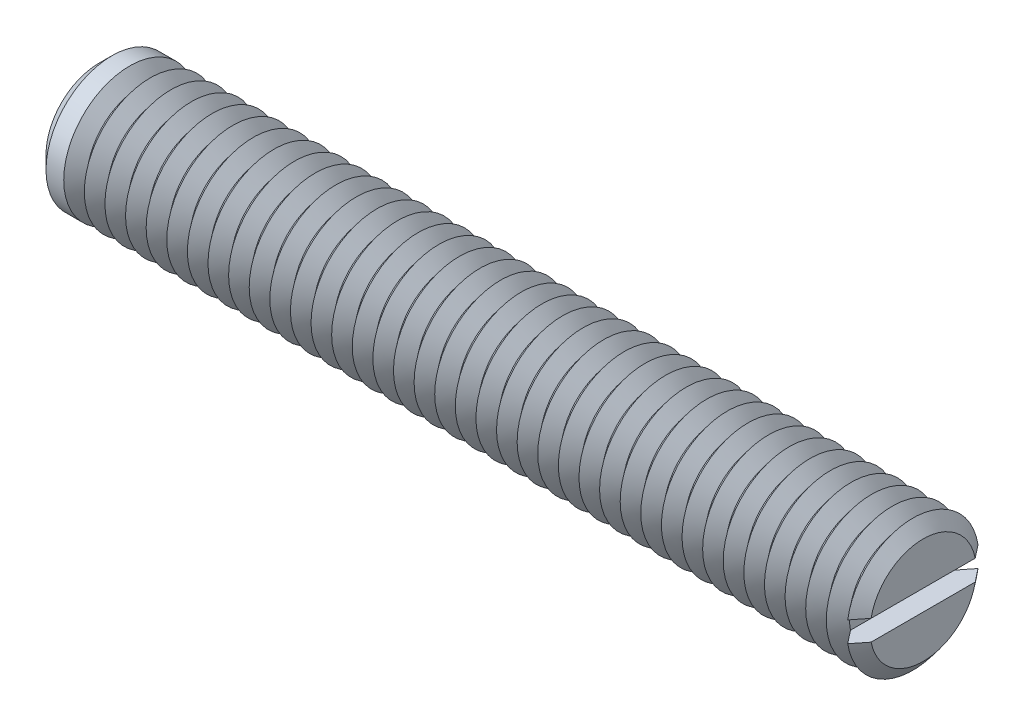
ISO-10303-21;
HEADER;
FILE_DESCRIPTION(('STEP AP214'),'2;1');
FILE_NAME('part.step','',(''),(''),'','','');
FILE_SCHEMA(('AUTOMOTIVE_DESIGN { 1 0 10303 214 1 1 1 1 }'));
ENDSEC;
DATA;
#1=APPLICATION_CONTEXT('core data for automotive mechanical design processes');
#2=APPLICATION_PROTOCOL_DEFINITION('international standard','automotive_design',2000,#1);
#3=PRODUCT_CONTEXT('',#1,'mechanical');
#4=PRODUCT('Part','Part','',(#3));
#5=PRODUCT_RELATED_PRODUCT_CATEGORY('part','',(#4));
#6=PRODUCT_DEFINITION_FORMATION('','',#4);
#7=PRODUCT_DEFINITION_CONTEXT('part definition',#1,'design');
#8=PRODUCT_DEFINITION('design','',#6,#7);
#9=PRODUCT_DEFINITION_SHAPE('','',#8);
#10=(LENGTH_UNIT() NAMED_UNIT(*) SI_UNIT(.MILLI.,.METRE.));
#11=(NAMED_UNIT(*) PLANE_ANGLE_UNIT() SI_UNIT($,.RADIAN.));
#12=(NAMED_UNIT(*) SI_UNIT($,.STERADIAN.) SOLID_ANGLE_UNIT());
#13=UNCERTAINTY_MEASURE_WITH_UNIT(LENGTH_MEASURE(1.E-05),#10,'distance_accuracy_value','');
#14=(GEOMETRIC_REPRESENTATION_CONTEXT(3) GLOBAL_UNCERTAINTY_ASSIGNED_CONTEXT((#13)) GLOBAL_UNIT_ASSIGNED_CONTEXT((#10,
#11,#12)) REPRESENTATION_CONTEXT('',''));
#15=CARTESIAN_POINT('',(0.,0.,0.));
#16=DIRECTION('',(0.,0.,1.));
#17=DIRECTION('',(1.,0.,0.));
#18=AXIS2_PLACEMENT_3D('',#15,#16,#17);
#19=CARTESIAN_POINT('',(24.375,0.,0.));
#20=DIRECTION('',(1.,0.,0.));
#21=DIRECTION('',(0.,0.,-1.));
#22=AXIS2_PLACEMENT_3D('',#19,#20,#21);
#23=CONICAL_SURFACE('',#22,4.,0.895664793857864);
#24=CARTESIAN_POINT('',(24.375,0.,0.));
#25=DIRECTION('',(-1.,0.,0.));
#26=DIRECTION('',(0.,0.,1.));
#27=AXIS2_PLACEMENT_3D('',#24,#25,#26);
#28=CIRCLE('',#27,4.);
#29=CARTESIAN_POINT('',(24.375,-0.625,-3.95087015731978));
#30=VERTEX_POINT('',#29);
#31=CARTESIAN_POINT('',(24.375,-0.625,3.95087015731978));
#32=VERTEX_POINT('',#31);
#33=EDGE_CURVE('E117',#30,#32,#28,.T.);
#34=ORIENTED_EDGE('',*,*,#33,.T.);
#35=CARTESIAN_POINT('',(28.1614902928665,-0.625,-8.70692181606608));
#36=CARTESIAN_POINT('',(27.9148555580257,-0.625,-8.39807520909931));
#37=CARTESIAN_POINT('',(27.6682552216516,-0.625,-8.08920109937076));
#38=CARTESIAN_POINT('',(27.17514080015,-0.625,-7.47132164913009));
#39=CARTESIAN_POINT('',(26.9286267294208,-0.625,-7.16231629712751));
#40=CARTESIAN_POINT('',(26.4351922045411,-0.625,-6.54345822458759));
#41=CARTESIAN_POINT('',(26.1882721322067,-0.625,-6.23360519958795));
#42=CARTESIAN_POINT('',(25.6947157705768,-0.625,-5.61373487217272));
#43=CARTESIAN_POINT('',(25.4480794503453,-0.625,-5.3037175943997));
#44=CARTESIAN_POINT('',(25.0704817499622,-0.625,-4.82841623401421));
#45=CARTESIAN_POINT('',(24.9393680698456,-0.625,-4.66325315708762));
#46=CARTESIAN_POINT('',(24.6773052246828,-0.625,-4.33279290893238));
#47=CARTESIAN_POINT('',(24.5463560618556,-0.625,-4.16749573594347));
#48=CARTESIAN_POINT('',(24.2846416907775,-0.625,-3.83665276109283));
#49=CARTESIAN_POINT('',(24.1538765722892,-0.625,-3.67110688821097));
#50=CARTESIAN_POINT('',(23.892697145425,-0.625,-3.33975147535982));
#51=CARTESIAN_POINT('',(23.7622828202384,-0.625,-3.17394194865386));
#52=CARTESIAN_POINT('',(23.5022082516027,-0.625,-2.84217045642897));
#53=CARTESIAN_POINT('',(23.3725471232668,-0.625,-2.6762091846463));
#54=CARTESIAN_POINT('',(23.1140928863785,-0.625,-2.34356113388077));
#55=CARTESIAN_POINT('',(22.985299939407,-0.625,-2.17687422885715));
#56=CARTESIAN_POINT('',(22.7934479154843,-0.625,-1.92591523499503));
#57=CARTESIAN_POINT('',(22.7297426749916,-0.625,-1.84213757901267));
#58=CARTESIAN_POINT('',(22.6029724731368,-0.625,-1.67409978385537));
#59=CARTESIAN_POINT('',(22.5399075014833,-0.625,-1.58983965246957));
#60=CARTESIAN_POINT('',(22.4147785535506,-0.625,-1.42061659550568));
#61=CARTESIAN_POINT('',(22.3527142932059,-0.625,-1.33565388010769));
#62=CARTESIAN_POINT('',(22.2301881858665,-0.625,-1.16458302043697));
#63=CARTESIAN_POINT('',(22.1697261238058,-0.625,-1.0784750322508));
#64=CARTESIAN_POINT('',(22.0976838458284,-0.625,-0.97209256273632));
#65=CARTESIAN_POINT('',(22.0847024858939,-0.625,-0.952767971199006));
#66=CARTESIAN_POINT('',(22.0589128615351,-0.625,-0.914003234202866));
#67=CARTESIAN_POINT('',(22.0461046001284,-0.625,-0.894563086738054));
#68=CARTESIAN_POINT('',(22.0079767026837,-0.625,-0.836043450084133));
#69=CARTESIAN_POINT('',(21.9829560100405,-0.625,-0.79676778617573));
#70=CARTESIAN_POINT('',(21.9339776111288,-0.625,-0.717444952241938));
#71=CARTESIAN_POINT('',(21.9100221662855,-0.625,-0.677396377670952));
#72=CARTESIAN_POINT('',(21.8637207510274,-0.625,-0.596377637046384));
#73=CARTESIAN_POINT('',(21.8413744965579,-0.625,-0.555407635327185));
#74=CARTESIAN_POINT('',(21.8059952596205,-0.625,-0.485816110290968));
#75=CARTESIAN_POINT('',(21.7923049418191,-0.625,-0.457533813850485));
#76=CARTESIAN_POINT('',(21.766378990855,-0.625,-0.400313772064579));
#77=CARTESIAN_POINT('',(21.7541438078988,-0.625,-0.371375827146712));
#78=CARTESIAN_POINT('',(21.7204304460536,-0.625,-0.283641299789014));
#79=CARTESIAN_POINT('',(21.7017774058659,-0.625,-0.22361745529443));
#80=CARTESIAN_POINT('',(21.6847644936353,-0.625,-0.139102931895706));
#81=CARTESIAN_POINT('',(21.68099555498,-0.625,-0.115688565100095));
#82=CARTESIAN_POINT('',(21.6755004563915,-0.625,-0.0686260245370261));
#83=CARTESIAN_POINT('',(21.6737732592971,-0.625,-0.0449779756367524));
#84=CARTESIAN_POINT('',(21.6724835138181,-0.625,0.00234331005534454));
#85=CARTESIAN_POINT('',(21.672917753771,-0.625,0.0260164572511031));
#86=CARTESIAN_POINT('',(21.6759063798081,-0.625,0.0732268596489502));
#87=CARTESIAN_POINT('',(21.6784611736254,-0.625,0.0967640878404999));
#88=CARTESIAN_POINT('',(21.691400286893,-0.625,0.182271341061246));
#89=CARTESIAN_POINT('',(21.707744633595,-0.625,0.243366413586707));
#90=CARTESIAN_POINT('',(21.7388887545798,-0.625,0.332669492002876));
#91=CARTESIAN_POINT('',(21.7504419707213,-0.625,0.362174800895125));
#92=CARTESIAN_POINT('',(21.7752210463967,-0.625,0.420481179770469));
#93=CARTESIAN_POINT('',(21.7884464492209,-0.625,0.449282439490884));
#94=CARTESIAN_POINT('',(21.8174677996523,-0.625,0.508972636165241));
#95=CARTESIAN_POINT('',(21.8333885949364,-0.625,0.539799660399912));
#96=CARTESIAN_POINT('',(21.8663425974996,-0.625,0.600856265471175));
#97=CARTESIAN_POINT('',(21.8833759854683,-0.625,0.631085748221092));
#98=CARTESIAN_POINT('',(21.9357348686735,-0.625,0.72110013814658));
#99=CARTESIAN_POINT('',(21.9722948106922,-0.625,0.780163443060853));
#100=CARTESIAN_POINT('',(22.0474296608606,-0.625,0.897183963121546));
#101=CARTESIAN_POINT('',(22.0860094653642,-0.625,0.95513797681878));
#102=CARTESIAN_POINT('',(22.1644096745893,-0.625,1.0702065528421));
#103=CARTESIAN_POINT('',(22.2042302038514,-0.625,1.12732103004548));
#104=CARTESIAN_POINT('',(22.2847841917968,-0.625,1.24108525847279));
#105=CARTESIAN_POINT('',(22.3255194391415,-0.625,1.29773373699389));
#106=CARTESIAN_POINT('',(22.4075780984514,-0.625,1.4106117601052));
#107=CARTESIAN_POINT('',(22.4489015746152,-0.625,1.46684125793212));
#108=CARTESIAN_POINT('',(22.5733456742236,-0.625,1.63486189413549));
#109=CARTESIAN_POINT('',(22.6570882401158,-0.625,1.74619171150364));
#110=CARTESIAN_POINT('',(22.8245788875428,-0.625,1.96690364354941));
#111=CARTESIAN_POINT('',(22.9083166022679,-0.625,2.07629366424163));
#112=CARTESIAN_POINT('',(23.0763821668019,-0.625,2.29462016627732));
#113=CARTESIAN_POINT('',(23.1607100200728,-0.625,2.40355664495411));
#114=CARTESIAN_POINT('',(23.4142762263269,-0.625,2.72992534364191));
#115=CARTESIAN_POINT('',(23.5840912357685,-0.625,2.94690900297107));
#116=CARTESIAN_POINT('',(23.9246141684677,-0.625,3.38042406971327));
#117=CARTESIAN_POINT('',(24.095322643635,-0.625,3.5969550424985));
#118=CARTESIAN_POINT('',(24.4371950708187,-0.625,4.02965109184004));
#119=CARTESIAN_POINT('',(24.6083590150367,-0.625,4.24581617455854));
#120=CARTESIAN_POINT('',(24.9504500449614,-0.625,4.67725748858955));
#121=CARTESIAN_POINT('',(25.1213762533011,-0.625,4.89253441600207));
#122=CARTESIAN_POINT('',(25.4634226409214,-0.625,5.32293566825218));
#123=CARTESIAN_POINT('',(25.634542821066,-0.625,5.53805999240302));
#124=CARTESIAN_POINT('',(26.1480384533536,-0.625,6.18319284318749));
#125=CARTESIAN_POINT('',(26.4906134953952,-0.625,6.6130424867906));
#126=CARTESIAN_POINT('',(26.9438892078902,-0.625,7.18140561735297));
#127=CARTESIAN_POINT('',(27.0544613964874,-0.625,7.32002163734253));
#128=CARTESIAN_POINT('',(27.2756363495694,-0.625,7.59723760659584));
#129=CARTESIAN_POINT('',(27.386239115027,-0.625,7.73583755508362));
#130=CARTESIAN_POINT('',(27.6076076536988,-0.625,8.01319622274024));
#131=CARTESIAN_POINT('',(27.7183734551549,-0.625,8.15195491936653));
#132=CARTESIAN_POINT('',(27.939920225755,-0.625,8.42945184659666));
#133=CARTESIAN_POINT('',(28.0507011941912,-0.625,8.56819007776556));
#134=CARTESIAN_POINT('',(28.1614902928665,-0.625,8.70692181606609));
#135=B_SPLINE_CURVE_WITH_KNOTS('',3,(#35,#36,#37,#38,#39,#40,#41,#42,#43,#44,#45,#46,#47,#48,
#49,#50,#51,#52,#53,#54,#55,#56,#57,#58,#59,#60,#61,#62,#63,#64,#65,#66,#67,#68,#69,#70,#71,#72,
#73,#74,#75,#76,#77,#78,#79,#80,#81,#82,#83,#84,#85,#86,#87,#88,#89,#90,#91,#92,#93,#94,#95,#96,
#97,#98,#99,#100,#101,#102,#103,#104,#105,#106,#107,#108,#109,#110,#111,#112,#113,#114,#115,
#116,#117,#118,#119,#120,#121,#122,#123,#124,#125,#126,#127,#128,#129,#130,#131,#132,#133,#134),
.UNSPECIFIED.,.F.,.F.,(4,2,2,2,2,2,2,2,2,2,2,2,2,2,2,2,2,2,2,2,2,2,2,2,2,2,2,2,2,2,2,2,2,2,2,2,
2,2,2,2,2,2,2,2,2,2,2,2,2,4),(0.,1.18572103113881,2.37158837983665,3.56020338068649,
4.74867342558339,5.38130812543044,6.01395126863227,6.64683693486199,7.27969171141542,
7.91151062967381,8.54344406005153,8.85918511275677,9.17492108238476,9.49056578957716,
9.8061679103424,9.8760068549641,9.94584701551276,10.0855382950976,10.2255132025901,
10.3654633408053,10.4596856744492,10.5539370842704,10.741396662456,10.8124690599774,
10.8835053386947,10.9544360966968,11.0253804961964,11.2137597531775,11.3088096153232,
11.403833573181,11.5078935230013,11.6119704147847,11.8202840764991,12.0291284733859,
12.2379939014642,12.4473111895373,12.6566515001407,13.0745694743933,13.4878513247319,
13.9011356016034,14.7277337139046,15.5549232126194,16.3820986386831,17.2067434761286,
18.0313920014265,19.6803778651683,20.2123228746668,20.7442873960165,21.2769292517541,
21.8095515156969),.UNSPECIFIED.);
#136=CARTESIAN_POINT('',(23.75,-0.625,3.1581247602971));
#137=VERTEX_POINT('',#136);
#138=EDGE_CURVE('E109',#137,#32,#135,.T.);
#139=ORIENTED_EDGE('',*,*,#138,.F.);
#140=CARTESIAN_POINT('',(23.75,0.,0.));
#141=DIRECTION('',(-1.,0.,0.));
#142=DIRECTION('',(0.,0.,1.));
#143=AXIS2_PLACEMENT_3D('',#140,#141,#142);
#144=CIRCLE('',#143,3.2193752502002);
#145=CARTESIAN_POINT('',(23.75,-0.625,-3.1581247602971));
#146=VERTEX_POINT('',#145);
#147=EDGE_CURVE('E529',#146,#137,#144,.T.);
#148=ORIENTED_EDGE('',*,*,#147,.F.);
#149=EDGE_CURVE('E58',#30,#146,#135,.T.);
#150=ORIENTED_EDGE('',*,*,#149,.F.);
#151=EDGE_LOOP('',(#34,#139,#148,#150));
#152=FACE_BOUND('',#151,.T.);
#153=ADVANCED_FACE('F37',(#152),#23,.T.);
#154=CARTESIAN_POINT('',(24.375,0.625,3.95087015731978));
#155=VERTEX_POINT('',#154);
#156=CARTESIAN_POINT('',(24.375,0.625,-3.95087015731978));
#157=VERTEX_POINT('',#156);
#158=EDGE_CURVE('E100',#155,#157,#28,.T.);
#159=ORIENTED_EDGE('',*,*,#158,.T.);
#160=CARTESIAN_POINT('',(28.1614902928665,0.625,8.70692181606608));
#161=CARTESIAN_POINT('',(27.9148555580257,0.625,8.39807520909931));
#162=CARTESIAN_POINT('',(27.6682552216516,0.625,8.08920109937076));
#163=CARTESIAN_POINT('',(27.1751408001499,0.625,7.47132164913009));
#164=CARTESIAN_POINT('',(26.9286267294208,0.625,7.16231629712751));
#165=CARTESIAN_POINT('',(26.4351922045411,0.625,6.54345822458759));
#166=CARTESIAN_POINT('',(26.1882721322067,0.625,6.23360519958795));
#167=CARTESIAN_POINT('',(25.6947157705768,0.625,5.61373487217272));
#168=CARTESIAN_POINT('',(25.4480794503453,0.625,5.3037175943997));
#169=CARTESIAN_POINT('',(25.0704817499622,0.625,4.82841623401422));
#170=CARTESIAN_POINT('',(24.9393680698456,0.625,4.66325315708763));
#171=CARTESIAN_POINT('',(24.6773052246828,0.625,4.33279290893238));
#172=CARTESIAN_POINT('',(24.5463560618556,0.625,4.16749573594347));
#173=CARTESIAN_POINT('',(24.2846416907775,0.625,3.83665276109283));
#174=CARTESIAN_POINT('',(24.1538765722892,0.625,3.67110688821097));
#175=CARTESIAN_POINT('',(23.892697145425,0.625,3.33975147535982));
#176=CARTESIAN_POINT('',(23.7622828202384,0.625,3.17394194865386));
#177=CARTESIAN_POINT('',(23.5022082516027,0.625,2.84217045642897));
#178=CARTESIAN_POINT('',(23.3725471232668,0.625,2.6762091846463));
#179=CARTESIAN_POINT('',(23.1140928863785,0.625,2.34356113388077));
#180=CARTESIAN_POINT('',(22.985299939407,0.625,2.17687422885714));
#181=CARTESIAN_POINT('',(22.7934479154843,0.625,1.92591523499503));
#182=CARTESIAN_POINT('',(22.7297426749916,0.625,1.84213757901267));
#183=CARTESIAN_POINT('',(22.6029724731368,0.625,1.67409978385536));
#184=CARTESIAN_POINT('',(22.5399075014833,0.625,1.58983965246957));
#185=CARTESIAN_POINT('',(22.4147785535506,0.625,1.42061659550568));
#186=CARTESIAN_POINT('',(22.3527142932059,0.625,1.33565388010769));
#187=CARTESIAN_POINT('',(22.2301881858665,0.625,1.16458302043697));
#188=CARTESIAN_POINT('',(22.1697261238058,0.625,1.07847503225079));
#189=CARTESIAN_POINT('',(22.0976838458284,0.625,0.97209256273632));
#190=CARTESIAN_POINT('',(22.0847024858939,0.625,0.952767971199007));
#191=CARTESIAN_POINT('',(22.0589128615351,0.625,0.914003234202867));
#192=CARTESIAN_POINT('',(22.0461046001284,0.625,0.894563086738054));
#193=CARTESIAN_POINT('',(22.0079767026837,0.625,0.836043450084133));
#194=CARTESIAN_POINT('',(21.9829560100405,0.625,0.79676778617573));
#195=CARTESIAN_POINT('',(21.9339776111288,0.625,0.717444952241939));
#196=CARTESIAN_POINT('',(21.9100221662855,0.625,0.677396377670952));
#197=CARTESIAN_POINT('',(21.8637207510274,0.625,0.596377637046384));
#198=CARTESIAN_POINT('',(21.8413744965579,0.625,0.555407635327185));
#199=CARTESIAN_POINT('',(21.8059952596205,0.625,0.485816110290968));
#200=CARTESIAN_POINT('',(21.7923049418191,0.625,0.457533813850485));
#201=CARTESIAN_POINT('',(21.766378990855,0.625,0.400313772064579));
#202=CARTESIAN_POINT('',(21.7541438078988,0.625,0.371375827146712));
#203=CARTESIAN_POINT('',(21.7204304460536,0.625,0.283641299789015));
#204=CARTESIAN_POINT('',(21.7017774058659,0.625,0.223617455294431));
#205=CARTESIAN_POINT('',(21.6847644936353,0.625,0.139102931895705));
#206=CARTESIAN_POINT('',(21.68099555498,0.625,0.115688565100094));
#207=CARTESIAN_POINT('',(21.6755004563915,0.625,0.0686260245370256));
#208=CARTESIAN_POINT('',(21.6737732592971,0.625,0.0449779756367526));
#209=CARTESIAN_POINT('',(21.6724835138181,0.625,-0.00234331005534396));
#210=CARTESIAN_POINT('',(21.672917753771,0.625,-0.026016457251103));
#211=CARTESIAN_POINT('',(21.6759063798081,0.625,-0.0732268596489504));
#212=CARTESIAN_POINT('',(21.6784611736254,0.625,-0.0967640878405));
#213=CARTESIAN_POINT('',(21.691400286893,0.625,-0.182271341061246));
#214=CARTESIAN_POINT('',(21.707744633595,0.625,-0.243366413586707));
#215=CARTESIAN_POINT('',(21.7388887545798,0.625,-0.332669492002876));
#216=CARTESIAN_POINT('',(21.7504419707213,0.625,-0.362174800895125));
#217=CARTESIAN_POINT('',(21.7752210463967,0.625,-0.420481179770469));
#218=CARTESIAN_POINT('',(21.7884464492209,0.625,-0.449282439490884));
#219=CARTESIAN_POINT('',(21.8174677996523,0.625,-0.508972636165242));
#220=CARTESIAN_POINT('',(21.8333885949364,0.625,-0.539799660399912));
#221=CARTESIAN_POINT('',(21.8663425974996,0.625,-0.600856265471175));
#222=CARTESIAN_POINT('',(21.8833759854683,0.625,-0.631085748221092));
#223=CARTESIAN_POINT('',(21.9357348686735,0.625,-0.72110013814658));
#224=CARTESIAN_POINT('',(21.9722948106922,0.625,-0.780163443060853));
#225=CARTESIAN_POINT('',(22.0474296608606,0.625,-0.897183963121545));
#226=CARTESIAN_POINT('',(22.0860094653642,0.625,-0.955137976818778));
#227=CARTESIAN_POINT('',(22.1644096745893,0.625,-1.0702065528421));
#228=CARTESIAN_POINT('',(22.2042302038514,0.625,-1.12732103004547));
#229=CARTESIAN_POINT('',(22.2847841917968,0.625,-1.24108525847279));
#230=CARTESIAN_POINT('',(22.3255194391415,0.625,-1.29773373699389));
#231=CARTESIAN_POINT('',(22.4075780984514,0.625,-1.4106117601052));
#232=CARTESIAN_POINT('',(22.4489015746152,0.625,-1.46684125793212));
#233=CARTESIAN_POINT('',(22.5733456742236,0.625,-1.63486189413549));
#234=CARTESIAN_POINT('',(22.6570882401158,0.625,-1.74619171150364));
#235=CARTESIAN_POINT('',(22.8245788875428,0.625,-1.96690364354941));
#236=CARTESIAN_POINT('',(22.9083166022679,0.625,-2.07629366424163));
#237=CARTESIAN_POINT('',(23.0763821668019,0.625,-2.29462016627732));
#238=CARTESIAN_POINT('',(23.1607100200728,0.625,-2.40355664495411));
#239=CARTESIAN_POINT('',(23.4142762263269,0.625,-2.72992534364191));
#240=CARTESIAN_POINT('',(23.5840912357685,0.625,-2.94690900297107));
#241=CARTESIAN_POINT('',(23.9246141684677,0.625,-3.38042406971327));
#242=CARTESIAN_POINT('',(24.095322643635,0.625,-3.5969550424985));
#243=CARTESIAN_POINT('',(24.4371950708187,0.625,-4.02965109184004));
#244=CARTESIAN_POINT('',(24.6083590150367,0.625,-4.24581617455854));
#245=CARTESIAN_POINT('',(24.9504500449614,0.625,-4.67725748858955));
#246=CARTESIAN_POINT('',(25.1213762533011,0.625,-4.89253441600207));
#247=CARTESIAN_POINT('',(25.4634226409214,0.625,-5.32293566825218));
#248=CARTESIAN_POINT('',(25.634542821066,0.625,-5.53805999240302));
#249=CARTESIAN_POINT('',(26.1480384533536,0.625,-6.18319284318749));
#250=CARTESIAN_POINT('',(26.4906134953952,0.625,-6.6130424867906));
#251=CARTESIAN_POINT('',(26.9438892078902,0.625,-7.18140561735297));
#252=CARTESIAN_POINT('',(27.0544613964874,0.625,-7.32002163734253));
#253=CARTESIAN_POINT('',(27.2756363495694,0.625,-7.59723760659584));
#254=CARTESIAN_POINT('',(27.386239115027,0.625,-7.73583755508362));
#255=CARTESIAN_POINT('',(27.6076076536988,0.625,-8.01319622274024));
#256=CARTESIAN_POINT('',(27.7183734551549,0.625,-8.15195491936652));
#257=CARTESIAN_POINT('',(27.939920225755,0.625,-8.42945184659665));
#258=CARTESIAN_POINT('',(28.0507011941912,0.625,-8.56819007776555));
#259=CARTESIAN_POINT('',(28.1614902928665,0.625,-8.70692181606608));
#260=B_SPLINE_CURVE_WITH_KNOTS('',3,(#160,#161,#162,#163,#164,#165,#166,#167,#168,#169,#170,
#171,#172,#173,#174,#175,#176,#177,#178,#179,#180,#181,#182,#183,#184,#185,#186,#187,#188,#189,
#190,#191,#192,#193,#194,#195,#196,#197,#198,#199,#200,#201,#202,#203,#204,#205,#206,#207,#208,
#209,#210,#211,#212,#213,#214,#215,#216,#217,#218,#219,#220,#221,#222,#223,#224,#225,#226,#227,
#228,#229,#230,#231,#232,#233,#234,#235,#236,#237,#238,#239,#240,#241,#242,#243,#244,#245,#246,
#247,#248,#249,#250,#251,#252,#253,#254,#255,#256,#257,#258,#259),.UNSPECIFIED.,.F.,.F.,(4,2,2,
2,2,2,2,2,2,2,2,2,2,2,2,2,2,2,2,2,2,2,2,2,2,2,2,2,2,2,2,2,2,2,2,2,2,2,2,2,2,2,2,2,2,2,2,2,2,4),
(0.,1.18572103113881,2.37158837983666,3.56020338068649,4.74867342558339,5.38130812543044,
6.01395126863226,6.64683693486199,7.27969171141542,7.91151062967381,8.54344406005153,
8.85918511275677,9.17492108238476,9.49056578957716,9.8061679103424,9.8760068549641,
9.94584701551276,10.0855382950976,10.2255132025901,10.3654633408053,10.4596856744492,
10.5539370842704,10.741396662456,10.8124690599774,10.8835053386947,10.9544360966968,
11.0253804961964,11.2137597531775,11.3088096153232,11.403833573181,11.5078935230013,
11.6119704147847,11.8202840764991,12.0291284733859,12.2379939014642,12.4473111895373,
12.6566515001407,13.0745694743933,13.4878513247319,13.9011356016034,14.7277337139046,
15.5549232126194,16.3820986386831,17.2067434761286,18.0313920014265,19.6803778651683,
20.2123228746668,20.7442873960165,21.2769292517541,21.8095515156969),.UNSPECIFIED.);
#261=CARTESIAN_POINT('',(23.75,0.625,-3.1581247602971));
#262=VERTEX_POINT('',#261);
#263=EDGE_CURVE('E110',#262,#157,#260,.T.);
#264=ORIENTED_EDGE('',*,*,#263,.F.);
#265=CARTESIAN_POINT('',(23.75,0.625,3.1581247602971));
#266=VERTEX_POINT('',#265);
#267=EDGE_CURVE('E103',#266,#262,#144,.T.);
#268=ORIENTED_EDGE('',*,*,#267,.F.);
#269=EDGE_CURVE('E97',#155,#266,#260,.T.);
#270=ORIENTED_EDGE('',*,*,#269,.F.);
#271=EDGE_LOOP('',(#159,#264,#268,#270));
#272=FACE_BOUND('',#271,.T.);
#273=ADVANCED_FACE('F99',(#272),#23,.T.);
#274=CARTESIAN_POINT('',(23.75,0.,0.));
#275=DIRECTION('',(-1.,0.,0.));
#276=DIRECTION('',(0.,0.,1.));
#277=AXIS2_PLACEMENT_3D('',#274,#275,#276);
#278=CONICAL_SURFACE('',#277,3.2193752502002,0.895664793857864);
#279=CARTESIAN_POINT('',(23.125,0.,0.));
#280=DIRECTION('',(-1.,0.,0.));
#281=DIRECTION('',(0.,0.,1.));
#282=AXIS2_PLACEMENT_3D('',#279,#280,#281);
#283=CIRCLE('',#282,4.);
#284=CARTESIAN_POINT('',(23.125,0.,4.));
#285=VERTEX_POINT('',#284);
#286=EDGE_CURVE('E515',#285,#285,#283,.T.);
#287=ORIENTED_EDGE('',*,*,#286,.F.);
#288=EDGE_LOOP('',(#287));
#289=FACE_BOUND('',#288,.T.);
#290=ORIENTED_EDGE('',*,*,#267,.T.);
#291=EDGE_CURVE('E524',#262,#146,#144,.T.);
#292=ORIENTED_EDGE('',*,*,#291,.T.);
#293=ORIENTED_EDGE('',*,*,#147,.T.);
#294=EDGE_CURVE('E522',#137,#266,#144,.T.);
#295=ORIENTED_EDGE('',*,*,#294,.T.);
#296=EDGE_LOOP('',(#290,#292,#293,#295));
#297=FACE_BOUND('',#296,.T.);
#298=ADVANCED_FACE('F168',(#289,#297),#278,.T.);
#299=CARTESIAN_POINT('',(25.,0.,0.));
#300=DIRECTION('',(1.,0.,0.));
#301=DIRECTION('',(0.,0.,-1.));
#302=AXIS2_PLACEMENT_3D('',#299,#300,#301);
#303=PLANE('',#302);
#304=CARTESIAN_POINT('',(25.,0.,0.));
#305=DIRECTION('',(-1.,0.,0.));
#306=DIRECTION('',(0.,0.,1.));
#307=AXIS2_PLACEMENT_3D('',#304,#305,#306);
#308=CIRCLE('',#307,3.2193752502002);
#309=CARTESIAN_POINT('',(25.,0.625,3.1581247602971));
#310=VERTEX_POINT('',#309);
#311=CARTESIAN_POINT('',(25.,0.625,-3.1581247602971));
#312=VERTEX_POINT('',#311);
#313=EDGE_CURVE('E160',#310,#312,#308,.T.);
#314=ORIENTED_EDGE('',*,*,#313,.F.);
#315=DIRECTION('',(0.,0.,1.));
#316=VECTOR('',#315,1.);
#317=CARTESIAN_POINT('',(25.,0.625,0.));
#318=LINE('',#317,#316);
#319=EDGE_CURVE('E122',#312,#310,#318,.T.);
#320=ORIENTED_EDGE('',*,*,#319,.F.);
#321=EDGE_LOOP('',(#314,#320));
#322=FACE_BOUND('',#321,.T.);
#323=ADVANCED_FACE('F172',(#322),#303,.T.);
#324=CARTESIAN_POINT('',(25.,-0.625,-3.1581247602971));
#325=VERTEX_POINT('',#324);
#326=CARTESIAN_POINT('',(25.,-0.625,3.1581247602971));
#327=VERTEX_POINT('',#326);
#328=EDGE_CURVE('E66',#325,#327,#308,.T.);
#329=ORIENTED_EDGE('',*,*,#328,.F.);
#330=DIRECTION('',(0.,0.,-1.));
#331=VECTOR('',#330,1.);
#332=CARTESIAN_POINT('',(25.,-0.625,0.));
#333=LINE('',#332,#331);
#334=EDGE_CURVE('E136',#327,#325,#333,.T.);
#335=ORIENTED_EDGE('',*,*,#334,.F.);
#336=EDGE_LOOP('',(#329,#335));
#337=FACE_BOUND('',#336,.T.);
#338=ADVANCED_FACE('F201',(#337),#303,.T.);
#339=CARTESIAN_POINT('',(25.,0.,0.));
#340=DIRECTION('',(-1.,0.,0.));
#341=DIRECTION('',(0.,0.,1.));
#342=AXIS2_PLACEMENT_3D('',#339,#340,#341);
#343=CONICAL_SURFACE('',#342,3.2193752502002,0.895664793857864);
#344=ORIENTED_EDGE('',*,*,#158,.F.);
#345=CARTESIAN_POINT('',(20.5885097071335,0.625,-8.70692181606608));
#346=CARTESIAN_POINT('',(20.8351444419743,0.625,-8.39807520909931));
#347=CARTESIAN_POINT('',(21.0817447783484,0.625,-8.08920109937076));
#348=CARTESIAN_POINT('',(21.57485919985,0.625,-7.4713216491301));
#349=CARTESIAN_POINT('',(21.8213732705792,0.625,-7.16231629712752));
#350=CARTESIAN_POINT('',(22.3148077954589,0.625,-6.5434582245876));
#351=CARTESIAN_POINT('',(22.5617278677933,0.625,-6.23360519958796));
#352=CARTESIAN_POINT('',(23.0552842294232,0.625,-5.61373487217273));
#353=CARTESIAN_POINT('',(23.3019205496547,0.625,-5.30371759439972));
#354=CARTESIAN_POINT('',(23.6795182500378,0.625,-4.82841623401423));
#355=CARTESIAN_POINT('',(23.8106319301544,0.625,-4.66325315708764));
#356=CARTESIAN_POINT('',(24.0726947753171,0.625,-4.33279290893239));
#357=CARTESIAN_POINT('',(24.2036439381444,0.625,-4.16749573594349));
#358=CARTESIAN_POINT('',(24.4653583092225,0.625,-3.83665276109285));
#359=CARTESIAN_POINT('',(24.5961234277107,0.625,-3.67110688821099));
#360=CARTESIAN_POINT('',(24.857302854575,0.625,-3.33975147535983));
#361=CARTESIAN_POINT('',(24.9877171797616,0.625,-3.17394194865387));
#362=CARTESIAN_POINT('',(25.2477917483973,0.625,-2.84217045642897));
#363=CARTESIAN_POINT('',(25.3774528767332,0.625,-2.6762091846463));
#364=CARTESIAN_POINT('',(25.6359071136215,0.625,-2.34356113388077));
#365=CARTESIAN_POINT('',(25.764700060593,0.625,-2.17687422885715));
#366=CARTESIAN_POINT('',(25.9565520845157,0.625,-1.92591523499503));
#367=CARTESIAN_POINT('',(26.0202573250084,0.625,-1.84213757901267));
#368=CARTESIAN_POINT('',(26.1470275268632,0.625,-1.67409978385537));
#369=CARTESIAN_POINT('',(26.2100924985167,0.625,-1.58983965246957));
#370=CARTESIAN_POINT('',(26.3352214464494,0.625,-1.42061659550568));
#371=CARTESIAN_POINT('',(26.3972857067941,0.625,-1.3356538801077));
#372=CARTESIAN_POINT('',(26.5198118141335,0.625,-1.16458302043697));
#373=CARTESIAN_POINT('',(26.5802738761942,0.625,-1.0784750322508));
#374=CARTESIAN_POINT('',(26.6523161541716,0.625,-0.97209256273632));
#375=CARTESIAN_POINT('',(26.6652975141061,0.625,-0.952767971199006));
#376=CARTESIAN_POINT('',(26.691087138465,0.625,-0.914003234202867));
#377=CARTESIAN_POINT('',(26.7038953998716,0.625,-0.894563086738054));
#378=CARTESIAN_POINT('',(26.7420232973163,0.625,-0.836043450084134));
#379=CARTESIAN_POINT('',(26.7670439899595,0.625,-0.79676778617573));
#380=CARTESIAN_POINT('',(26.8160223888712,0.625,-0.717444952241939));
#381=CARTESIAN_POINT('',(26.8399778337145,0.625,-0.677396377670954));
#382=CARTESIAN_POINT('',(26.8862792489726,0.625,-0.596377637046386));
#383=CARTESIAN_POINT('',(26.9086255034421,0.625,-0.555407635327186));
#384=CARTESIAN_POINT('',(26.9440047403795,0.625,-0.485816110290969));
#385=CARTESIAN_POINT('',(26.9576950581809,0.625,-0.457533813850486));
#386=CARTESIAN_POINT('',(26.983621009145,0.625,-0.40031377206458));
#387=CARTESIAN_POINT('',(26.9958561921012,0.625,-0.371375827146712));
#388=CARTESIAN_POINT('',(27.0295695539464,0.625,-0.283641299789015));
#389=CARTESIAN_POINT('',(27.0482225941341,0.625,-0.223617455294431));
#390=CARTESIAN_POINT('',(27.0652355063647,0.625,-0.139102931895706));
#391=CARTESIAN_POINT('',(27.06900444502,0.625,-0.115688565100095));
#392=CARTESIAN_POINT('',(27.0744995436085,0.625,-0.0686260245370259));
#393=CARTESIAN_POINT('',(27.0762267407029,0.625,-0.0449779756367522));
#394=CARTESIAN_POINT('',(27.0775164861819,0.625,0.0023433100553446));
#395=CARTESIAN_POINT('',(27.077082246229,0.625,0.0260164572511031));
#396=CARTESIAN_POINT('',(27.0740936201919,0.625,0.0732268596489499));
#397=CARTESIAN_POINT('',(27.0715388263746,0.625,0.0967640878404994));
#398=CARTESIAN_POINT('',(27.058599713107,0.625,0.182271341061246));
#399=CARTESIAN_POINT('',(27.042255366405,0.625,0.243366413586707));
#400=CARTESIAN_POINT('',(27.0111112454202,0.625,0.332669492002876));
#401=CARTESIAN_POINT('',(26.9995580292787,0.625,0.362174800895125));
#402=CARTESIAN_POINT('',(26.9747789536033,0.625,0.420481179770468));
#403=CARTESIAN_POINT('',(26.9615535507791,0.625,0.449282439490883));
#404=CARTESIAN_POINT('',(26.9325322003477,0.625,0.508972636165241));
#405=CARTESIAN_POINT('',(26.9166114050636,0.625,0.539799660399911));
#406=CARTESIAN_POINT('',(26.8836574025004,0.625,0.600856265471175));
#407=CARTESIAN_POINT('',(26.8666240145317,0.625,0.631085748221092));
#408=CARTESIAN_POINT('',(26.8142651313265,0.625,0.721100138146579));
#409=CARTESIAN_POINT('',(26.7777051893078,0.625,0.780163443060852));
#410=CARTESIAN_POINT('',(26.7025703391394,0.625,0.897183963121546));
#411=CARTESIAN_POINT('',(26.6639905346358,0.625,0.95513797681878));
#412=CARTESIAN_POINT('',(26.5855903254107,0.625,1.0702065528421));
#413=CARTESIAN_POINT('',(26.5457697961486,0.625,1.12732103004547));
#414=CARTESIAN_POINT('',(26.4652158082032,0.625,1.24108525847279));
#415=CARTESIAN_POINT('',(26.4244805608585,0.625,1.29773373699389));
#416=CARTESIAN_POINT('',(26.3424219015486,0.625,1.4106117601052));
#417=CARTESIAN_POINT('',(26.3010984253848,0.625,1.46684125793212));
#418=CARTESIAN_POINT('',(26.1766543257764,0.625,1.63486189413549));
#419=CARTESIAN_POINT('',(26.0929117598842,0.625,1.74619171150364));
#420=CARTESIAN_POINT('',(25.9254211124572,0.625,1.96690364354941));
#421=CARTESIAN_POINT('',(25.8416833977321,0.625,2.07629366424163));
#422=CARTESIAN_POINT('',(25.6736178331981,0.625,2.29462016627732));
#423=CARTESIAN_POINT('',(25.5892899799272,0.625,2.40355664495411));
#424=CARTESIAN_POINT('',(25.3357237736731,0.625,2.72992534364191));
#425=CARTESIAN_POINT('',(25.1659087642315,0.625,2.94690900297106));
#426=CARTESIAN_POINT('',(24.8253858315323,0.625,3.38042406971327));
#427=CARTESIAN_POINT('',(24.654677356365,0.625,3.5969550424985));
#428=CARTESIAN_POINT('',(24.3128049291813,0.625,4.02965109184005));
#429=CARTESIAN_POINT('',(24.1416409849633,0.625,4.24581617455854));
#430=CARTESIAN_POINT('',(23.7995499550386,0.625,4.67725748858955));
#431=CARTESIAN_POINT('',(23.6286237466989,0.625,4.89253441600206));
#432=CARTESIAN_POINT('',(23.2865773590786,0.625,5.32293566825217));
#433=CARTESIAN_POINT('',(23.115457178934,0.625,5.53805999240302));
#434=CARTESIAN_POINT('',(22.6019615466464,0.625,6.18319284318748));
#435=CARTESIAN_POINT('',(22.2593865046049,0.625,6.6130424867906));
#436=CARTESIAN_POINT('',(21.8061107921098,0.625,7.18140561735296));
#437=CARTESIAN_POINT('',(21.6955386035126,0.625,7.32002163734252));
#438=CARTESIAN_POINT('',(21.4743636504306,0.625,7.59723760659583));
#439=CARTESIAN_POINT('',(21.363760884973,0.625,7.73583755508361));
#440=CARTESIAN_POINT('',(21.1423923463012,0.625,8.01319622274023));
#441=CARTESIAN_POINT('',(21.0316265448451,0.625,8.15195491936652));
#442=CARTESIAN_POINT('',(20.810079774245,0.625,8.42945184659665));
#443=CARTESIAN_POINT('',(20.6992988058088,0.625,8.56819007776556));
#444=CARTESIAN_POINT('',(20.5885097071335,0.625,8.70692181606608));
#445=B_SPLINE_CURVE_WITH_KNOTS('',3,(#345,#346,#347,#348,#349,#350,#351,#352,#353,#354,#355,
#356,#357,#358,#359,#360,#361,#362,#363,#364,#365,#366,#367,#368,#369,#370,#371,#372,#373,#374,
#375,#376,#377,#378,#379,#380,#381,#382,#383,#384,#385,#386,#387,#388,#389,#390,#391,#392,#393,
#394,#395,#396,#397,#398,#399,#400,#401,#402,#403,#404,#405,#406,#407,#408,#409,#410,#411,#412,
#413,#414,#415,#416,#417,#418,#419,#420,#421,#422,#423,#424,#425,#426,#427,#428,#429,#430,#431,
#432,#433,#434,#435,#436,#437,#438,#439,#440,#441,#442,#443,#444),.UNSPECIFIED.,.F.,.F.,(4,2,2,
2,2,2,2,2,2,2,2,2,2,2,2,2,2,2,2,2,2,2,2,2,2,2,2,2,2,2,2,2,2,2,2,2,2,2,2,2,2,2,2,2,2,2,2,2,2,4),
(0.,1.1857210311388,2.37158837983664,3.56020338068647,4.74867342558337,5.38130812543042,
6.01395126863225,6.64683693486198,7.27969171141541,7.91151062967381,8.54344406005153,
8.85918511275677,9.17492108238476,9.49056578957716,9.8061679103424,9.8760068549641,
9.94584701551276,10.0855382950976,10.2255132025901,10.3654633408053,10.4596856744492,
10.5539370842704,10.741396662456,10.8124690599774,10.8835053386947,10.9544360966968,
11.0253804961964,11.2137597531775,11.3088096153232,11.403833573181,11.5078935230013,
11.6119704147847,11.8202840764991,12.0291284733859,12.2379939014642,12.4473111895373,
12.6566515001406,13.0745694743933,13.4878513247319,13.9011356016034,14.7277337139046,
15.5549232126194,16.3820986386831,17.2067434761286,18.0313920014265,19.6803778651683,
20.2123228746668,20.7442873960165,21.2769292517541,21.8095515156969),.UNSPECIFIED.);
#446=EDGE_CURVE('E41',#310,#155,#445,.T.);
#447=ORIENTED_EDGE('',*,*,#446,.F.);
#448=ORIENTED_EDGE('',*,*,#313,.T.);
#449=EDGE_CURVE('E11',#157,#312,#445,.T.);
#450=ORIENTED_EDGE('',*,*,#449,.F.);
#451=EDGE_LOOP('',(#344,#447,#448,#450));
#452=FACE_BOUND('',#451,.T.);
#453=ADVANCED_FACE('F114',(#452),#343,.T.);
#454=CARTESIAN_POINT('',(25.,0.625,-6.));
#455=DIRECTION('',(0.,1.,0.));
#456=DIRECTION('',(0.,0.,1.));
#457=AXIS2_PLACEMENT_3D('',#454,#455,#456);
#458=PLANE('',#457);
#459=ORIENTED_EDGE('',*,*,#446,.T.);
#460=ORIENTED_EDGE('',*,*,#269,.T.);
#461=DIRECTION('',(0.,0.,1.));
#462=VECTOR('',#461,1.);
#463=CARTESIAN_POINT('',(23.75,0.625,-6.));
#464=LINE('',#463,#462);
#465=EDGE_CURVE('E145',#262,#266,#464,.T.);
#466=ORIENTED_EDGE('',*,*,#465,.F.);
#467=ORIENTED_EDGE('',*,*,#263,.T.);
#468=ORIENTED_EDGE('',*,*,#449,.T.);
#469=ORIENTED_EDGE('',*,*,#319,.T.);
#470=EDGE_LOOP('',(#459,#460,#466,#467,#468,#469));
#471=FACE_BOUND('',#470,.T.);
#472=ADVANCED_FACE('F120',(#471),#458,.F.);
#473=ORIENTED_EDGE('',*,*,#33,.F.);
#474=CARTESIAN_POINT('',(20.5885097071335,-0.625,8.70692181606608));
#475=CARTESIAN_POINT('',(20.8351444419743,-0.625,8.39807520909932));
#476=CARTESIAN_POINT('',(21.0817447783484,-0.625,8.08920109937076));
#477=CARTESIAN_POINT('',(21.57485919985,-0.625,7.4713216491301));
#478=CARTESIAN_POINT('',(21.8213732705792,-0.625,7.16231629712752));
#479=CARTESIAN_POINT('',(22.3148077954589,-0.625,6.54345822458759));
#480=CARTESIAN_POINT('',(22.5617278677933,-0.625,6.23360519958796));
#481=CARTESIAN_POINT('',(23.0552842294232,-0.625,5.61373487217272));
#482=CARTESIAN_POINT('',(23.3019205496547,-0.625,5.30371759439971));
#483=CARTESIAN_POINT('',(23.6795182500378,-0.625,4.82841623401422));
#484=CARTESIAN_POINT('',(23.8106319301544,-0.625,4.66325315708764));
#485=CARTESIAN_POINT('',(24.0726947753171,-0.625,4.33279290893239));
#486=CARTESIAN_POINT('',(24.2036439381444,-0.625,4.16749573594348));
#487=CARTESIAN_POINT('',(24.4653583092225,-0.625,3.83665276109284));
#488=CARTESIAN_POINT('',(24.5961234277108,-0.625,3.67110688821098));
#489=CARTESIAN_POINT('',(24.857302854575,-0.625,3.33975147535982));
#490=CARTESIAN_POINT('',(24.9877171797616,-0.625,3.17394194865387));
#491=CARTESIAN_POINT('',(25.2477917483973,-0.625,2.84217045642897));
#492=CARTESIAN_POINT('',(25.3774528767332,-0.625,2.6762091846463));
#493=CARTESIAN_POINT('',(25.6359071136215,-0.625,2.34356113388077));
#494=CARTESIAN_POINT('',(25.764700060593,-0.625,2.17687422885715));
#495=CARTESIAN_POINT('',(25.9565520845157,-0.625,1.92591523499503));
#496=CARTESIAN_POINT('',(26.0202573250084,-0.625,1.84213757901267));
#497=CARTESIAN_POINT('',(26.1470275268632,-0.625,1.67409978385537));
#498=CARTESIAN_POINT('',(26.2100924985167,-0.625,1.58983965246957));
#499=CARTESIAN_POINT('',(26.3352214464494,-0.625,1.42061659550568));
#500=CARTESIAN_POINT('',(26.3972857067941,-0.625,1.33565388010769));
#501=CARTESIAN_POINT('',(26.5198118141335,-0.625,1.16458302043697));
#502=CARTESIAN_POINT('',(26.5802738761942,-0.625,1.0784750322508));
#503=CARTESIAN_POINT('',(26.6523161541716,-0.625,0.97209256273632));
#504=CARTESIAN_POINT('',(26.6652975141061,-0.625,0.952767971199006));
#505=CARTESIAN_POINT('',(26.691087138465,-0.625,0.914003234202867));
#506=CARTESIAN_POINT('',(26.7038953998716,-0.625,0.894563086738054));
#507=CARTESIAN_POINT('',(26.7420232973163,-0.625,0.836043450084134));
#508=CARTESIAN_POINT('',(26.7670439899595,-0.625,0.79676778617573));
#509=CARTESIAN_POINT('',(26.8160223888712,-0.625,0.717444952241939));
#510=CARTESIAN_POINT('',(26.8399778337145,-0.625,0.677396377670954));
#511=CARTESIAN_POINT('',(26.8862792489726,-0.625,0.596377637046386));
#512=CARTESIAN_POINT('',(26.9086255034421,-0.625,0.555407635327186));
#513=CARTESIAN_POINT('',(26.9440047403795,-0.625,0.485816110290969));
#514=CARTESIAN_POINT('',(26.9576950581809,-0.625,0.457533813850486));
#515=CARTESIAN_POINT('',(26.983621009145,-0.625,0.40031377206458));
#516=CARTESIAN_POINT('',(26.9958561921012,-0.625,0.371375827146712));
#517=CARTESIAN_POINT('',(27.0295695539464,-0.625,0.283641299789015));
#518=CARTESIAN_POINT('',(27.0482225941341,-0.625,0.223617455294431));
#519=CARTESIAN_POINT('',(27.0652355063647,-0.625,0.139102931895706));
#520=CARTESIAN_POINT('',(27.06900444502,-0.625,0.115688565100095));
#521=CARTESIAN_POINT('',(27.0744995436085,-0.625,0.0686260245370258));
#522=CARTESIAN_POINT('',(27.0762267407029,-0.625,0.0449779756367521));
#523=CARTESIAN_POINT('',(27.0775164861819,-0.625,-0.00234331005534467));
#524=CARTESIAN_POINT('',(27.077082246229,-0.625,-0.0260164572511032));
#525=CARTESIAN_POINT('',(27.0740936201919,-0.625,-0.07322685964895));
#526=CARTESIAN_POINT('',(27.0715388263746,-0.625,-0.0967640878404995));
#527=CARTESIAN_POINT('',(27.058599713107,-0.625,-0.182271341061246));
#528=CARTESIAN_POINT('',(27.042255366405,-0.625,-0.243366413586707));
#529=CARTESIAN_POINT('',(27.0111112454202,-0.625,-0.332669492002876));
#530=CARTESIAN_POINT('',(26.9995580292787,-0.625,-0.362174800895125));
#531=CARTESIAN_POINT('',(26.9747789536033,-0.625,-0.420481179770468));
#532=CARTESIAN_POINT('',(26.9615535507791,-0.625,-0.449282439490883));
#533=CARTESIAN_POINT('',(26.9325322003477,-0.625,-0.50897263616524));
#534=CARTESIAN_POINT('',(26.9166114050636,-0.625,-0.539799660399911));
#535=CARTESIAN_POINT('',(26.8836574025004,-0.625,-0.600856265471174));
#536=CARTESIAN_POINT('',(26.8666240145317,-0.625,-0.631085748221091));
#537=CARTESIAN_POINT('',(26.8142651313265,-0.625,-0.721100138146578));
#538=CARTESIAN_POINT('',(26.7777051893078,-0.625,-0.780163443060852));
#539=CARTESIAN_POINT('',(26.7025703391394,-0.625,-0.897183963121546));
#540=CARTESIAN_POINT('',(26.6639905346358,-0.625,-0.955137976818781));
#541=CARTESIAN_POINT('',(26.5855903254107,-0.625,-1.07020655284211));
#542=CARTESIAN_POINT('',(26.5457697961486,-0.625,-1.12732103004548));
#543=CARTESIAN_POINT('',(26.4652158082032,-0.625,-1.24108525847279));
#544=CARTESIAN_POINT('',(26.4244805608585,-0.625,-1.29773373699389));
#545=CARTESIAN_POINT('',(26.3424219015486,-0.625,-1.4106117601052));
#546=CARTESIAN_POINT('',(26.3010984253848,-0.625,-1.46684125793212));
#547=CARTESIAN_POINT('',(26.1766543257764,-0.625,-1.63486189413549));
#548=CARTESIAN_POINT('',(26.0929117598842,-0.625,-1.74619171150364));
#549=CARTESIAN_POINT('',(25.9254211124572,-0.625,-1.96690364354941));
#550=CARTESIAN_POINT('',(25.8416833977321,-0.625,-2.07629366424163));
#551=CARTESIAN_POINT('',(25.6736178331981,-0.625,-2.29462016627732));
#552=CARTESIAN_POINT('',(25.5892899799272,-0.625,-2.40355664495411));
#553=CARTESIAN_POINT('',(25.3357237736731,-0.625,-2.72992534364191));
#554=CARTESIAN_POINT('',(25.1659087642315,-0.625,-2.94690900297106));
#555=CARTESIAN_POINT('',(24.8253858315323,-0.625,-3.38042406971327));
#556=CARTESIAN_POINT('',(24.654677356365,-0.625,-3.5969550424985));
#557=CARTESIAN_POINT('',(24.3128049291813,-0.625,-4.02965109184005));
#558=CARTESIAN_POINT('',(24.1416409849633,-0.625,-4.24581617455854));
#559=CARTESIAN_POINT('',(23.7995499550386,-0.625,-4.67725748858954));
#560=CARTESIAN_POINT('',(23.6286237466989,-0.625,-4.89253441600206));
#561=CARTESIAN_POINT('',(23.2865773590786,-0.625,-5.32293566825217));
#562=CARTESIAN_POINT('',(23.115457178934,-0.625,-5.53805999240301));
#563=CARTESIAN_POINT('',(22.6019615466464,-0.625,-6.18319284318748));
#564=CARTESIAN_POINT('',(22.2593865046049,-0.625,-6.61304248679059));
#565=CARTESIAN_POINT('',(21.8061107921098,-0.625,-7.18140561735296));
#566=CARTESIAN_POINT('',(21.6955386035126,-0.625,-7.32002163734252));
#567=CARTESIAN_POINT('',(21.4743636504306,-0.625,-7.59723760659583));
#568=CARTESIAN_POINT('',(21.363760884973,-0.625,-7.73583755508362));
#569=CARTESIAN_POINT('',(21.1423923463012,-0.625,-8.01319622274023));
#570=CARTESIAN_POINT('',(21.0316265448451,-0.625,-8.15195491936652));
#571=CARTESIAN_POINT('',(20.810079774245,-0.625,-8.42945184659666));
#572=CARTESIAN_POINT('',(20.6992988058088,-0.625,-8.56819007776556));
#573=CARTESIAN_POINT('',(20.5885097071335,-0.625,-8.70692181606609));
#574=B_SPLINE_CURVE_WITH_KNOTS('',3,(#474,#475,#476,#477,#478,#479,#480,#481,#482,#483,#484,
#485,#486,#487,#488,#489,#490,#491,#492,#493,#494,#495,#496,#497,#498,#499,#500,#501,#502,#503,
#504,#505,#506,#507,#508,#509,#510,#511,#512,#513,#514,#515,#516,#517,#518,#519,#520,#521,#522,
#523,#524,#525,#526,#527,#528,#529,#530,#531,#532,#533,#534,#535,#536,#537,#538,#539,#540,#541,
#542,#543,#544,#545,#546,#547,#548,#549,#550,#551,#552,#553,#554,#555,#556,#557,#558,#559,#560,
#561,#562,#563,#564,#565,#566,#567,#568,#569,#570,#571,#572,#573),.UNSPECIFIED.,.F.,.F.,(4,2,2,
2,2,2,2,2,2,2,2,2,2,2,2,2,2,2,2,2,2,2,2,2,2,2,2,2,2,2,2,2,2,2,2,2,2,2,2,2,2,2,2,2,2,2,2,2,2,4),
(0.,1.1857210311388,2.37158837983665,3.56020338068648,4.74867342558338,5.38130812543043,
6.01395126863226,6.64683693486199,7.27969171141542,7.91151062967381,8.54344406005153,
8.85918511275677,9.17492108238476,9.49056578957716,9.8061679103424,9.8760068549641,
9.94584701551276,10.0855382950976,10.2255132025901,10.3654633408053,10.4596856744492,
10.5539370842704,10.741396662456,10.8124690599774,10.8835053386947,10.9544360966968,
11.0253804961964,11.2137597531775,11.3088096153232,11.403833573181,11.5078935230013,
11.6119704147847,11.8202840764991,12.0291284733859,12.2379939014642,12.4473111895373,
12.6566515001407,13.0745694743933,13.4878513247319,13.9011356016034,14.7277337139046,
15.5549232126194,16.3820986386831,17.2067434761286,18.0313920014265,19.6803778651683,
20.2123228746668,20.7442873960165,21.2769292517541,21.8095515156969),.UNSPECIFIED.);
#575=EDGE_CURVE('E152',#325,#30,#574,.T.);
#576=ORIENTED_EDGE('',*,*,#575,.F.);
#577=ORIENTED_EDGE('',*,*,#328,.T.);
#578=EDGE_CURVE('E148',#32,#327,#574,.T.);
#579=ORIENTED_EDGE('',*,*,#578,.F.);
#580=EDGE_LOOP('',(#473,#576,#577,#579));
#581=FACE_BOUND('',#580,.T.);
#582=ADVANCED_FACE('F164',(#581),#343,.T.);
#583=CARTESIAN_POINT('',(25.,-0.625,-6.));
#584=DIRECTION('',(0.,-1.,0.));
#585=DIRECTION('',(0.,0.,-1.));
#586=AXIS2_PLACEMENT_3D('',#583,#584,#585);
#587=PLANE('',#586);
#588=ORIENTED_EDGE('',*,*,#575,.T.);
#589=ORIENTED_EDGE('',*,*,#149,.T.);
#590=DIRECTION('',(0.,0.,1.));
#591=VECTOR('',#590,1.);
#592=CARTESIAN_POINT('',(23.75,-0.625,-6.));
#593=LINE('',#592,#591);
#594=EDGE_CURVE('E144',#146,#137,#593,.T.);
#595=ORIENTED_EDGE('',*,*,#594,.T.);
#596=ORIENTED_EDGE('',*,*,#138,.T.);
#597=ORIENTED_EDGE('',*,*,#578,.T.);
#598=ORIENTED_EDGE('',*,*,#334,.T.);
#599=EDGE_LOOP('',(#588,#589,#595,#596,#597,#598));
#600=FACE_BOUND('',#599,.T.);
#601=ADVANCED_FACE('F161',(#600),#587,.F.);
#602=CARTESIAN_POINT('',(23.75,0.625,-6.));
#603=DIRECTION('',(-1.,0.,0.));
#604=DIRECTION('',(0.,0.,1.));
#605=AXIS2_PLACEMENT_3D('',#602,#603,#604);
#606=PLANE('',#605);
#607=ORIENTED_EDGE('',*,*,#594,.F.);
#608=ORIENTED_EDGE('',*,*,#291,.F.);
#609=ORIENTED_EDGE('',*,*,#465,.T.);
#610=ORIENTED_EDGE('',*,*,#294,.F.);
#611=EDGE_LOOP('',(#607,#608,#609,#610));
#612=FACE_BOUND('',#611,.T.);
#613=ADVANCED_FACE('F533',(#612),#606,.F.);
#614=CARTESIAN_POINT('',(22.5,0.,0.));
#615=DIRECTION('',(-1.,0.,0.));
#616=DIRECTION('',(0.,0.,1.));
#617=AXIS2_PLACEMENT_3D('',#614,#615,#616);
#618=CONICAL_SURFACE('',#617,3.2193752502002,0.895664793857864);
#619=CARTESIAN_POINT('',(21.875,0.,0.));
#620=DIRECTION('',(-1.,0.,0.));
#621=DIRECTION('',(0.,0.,1.));
#622=AXIS2_PLACEMENT_3D('',#619,#620,#621);
#623=CIRCLE('',#622,4.);
#624=CARTESIAN_POINT('',(21.875,0.,4.));
#625=VERTEX_POINT('',#624);
#626=EDGE_CURVE('E507',#625,#625,#623,.T.);
#627=ORIENTED_EDGE('',*,*,#626,.F.);
#628=EDGE_LOOP('',(#627));
#629=FACE_BOUND('',#628,.T.);
#630=CARTESIAN_POINT('',(22.5,0.,0.));
#631=DIRECTION('',(-1.,0.,0.));
#632=DIRECTION('',(0.,0.,1.));
#633=AXIS2_PLACEMENT_3D('',#630,#631,#632);
#634=CIRCLE('',#633,3.2193752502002);
#635=CARTESIAN_POINT('',(22.5,0.,3.2193752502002));
#636=VERTEX_POINT('',#635);
#637=EDGE_CURVE('E519',#636,#636,#634,.T.);
#638=ORIENTED_EDGE('',*,*,#637,.T.);
#639=EDGE_LOOP('',(#638));
#640=FACE_BOUND('',#639,.T.);
#641=ADVANCED_FACE('F177',(#629,#640),#618,.T.);
#642=CARTESIAN_POINT('',(23.125,0.,0.));
#643=DIRECTION('',(1.,0.,0.));
#644=DIRECTION('',(0.,0.,-1.));
#645=AXIS2_PLACEMENT_3D('',#642,#643,#644);
#646=CONICAL_SURFACE('',#645,4.,0.895664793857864);
#647=ORIENTED_EDGE('',*,*,#637,.F.);
#648=EDGE_LOOP('',(#647));
#649=FACE_BOUND('',#648,.T.);
#650=ORIENTED_EDGE('',*,*,#286,.T.);
#651=EDGE_LOOP('',(#650));
#652=FACE_BOUND('',#651,.T.);
#653=ADVANCED_FACE('F539',(#649,#652),#646,.T.);
#654=CARTESIAN_POINT('',(21.25,0.,0.));
#655=DIRECTION('',(-1.,0.,0.));
#656=DIRECTION('',(0.,0.,1.));
#657=AXIS2_PLACEMENT_3D('',#654,#655,#656);
#658=CONICAL_SURFACE('',#657,3.2193752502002,0.895664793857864);
#659=CARTESIAN_POINT('',(20.625,0.,0.));
#660=DIRECTION('',(-1.,0.,0.));
#661=DIRECTION('',(0.,0.,1.));
#662=AXIS2_PLACEMENT_3D('',#659,#660,#661);
#663=CIRCLE('',#662,4.);
#664=CARTESIAN_POINT('',(20.625,0.,4.));
#665=VERTEX_POINT('',#664);
#666=EDGE_CURVE('E499',#665,#665,#663,.T.);
#667=ORIENTED_EDGE('',*,*,#666,.F.);
#668=EDGE_LOOP('',(#667));
#669=FACE_BOUND('',#668,.T.);
#670=CARTESIAN_POINT('',(21.25,0.,0.));
#671=DIRECTION('',(-1.,0.,0.));
#672=DIRECTION('',(0.,0.,1.));
#673=AXIS2_PLACEMENT_3D('',#670,#671,#672);
#674=CIRCLE('',#673,3.2193752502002);
#675=CARTESIAN_POINT('',(21.25,0.,3.2193752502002));
#676=VERTEX_POINT('',#675);
#677=EDGE_CURVE('E511',#676,#676,#674,.T.);
#678=ORIENTED_EDGE('',*,*,#677,.T.);
#679=EDGE_LOOP('',(#678));
#680=FACE_BOUND('',#679,.T.);
#681=ADVANCED_FACE('F603',(#669,#680),#658,.T.);
#682=CARTESIAN_POINT('',(21.875,0.,0.));
#683=DIRECTION('',(1.,0.,0.));
#684=DIRECTION('',(0.,0.,-1.));
#685=AXIS2_PLACEMENT_3D('',#682,#683,#684);
#686=CONICAL_SURFACE('',#685,4.,0.895664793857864);
#687=ORIENTED_EDGE('',*,*,#677,.F.);
#688=EDGE_LOOP('',(#687));
#689=FACE_BOUND('',#688,.T.);
#690=ORIENTED_EDGE('',*,*,#626,.T.);
#691=EDGE_LOOP('',(#690));
#692=FACE_BOUND('',#691,.T.);
#693=ADVANCED_FACE('F612',(#689,#692),#686,.T.);
#694=CARTESIAN_POINT('',(20.,0.,0.));
#695=DIRECTION('',(-1.,0.,0.));
#696=DIRECTION('',(0.,0.,1.));
#697=AXIS2_PLACEMENT_3D('',#694,#695,#696);
#698=CONICAL_SURFACE('',#697,3.2193752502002,0.895664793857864);
#699=CARTESIAN_POINT('',(19.375,0.,0.));
#700=DIRECTION('',(-1.,0.,0.));
#701=DIRECTION('',(0.,0.,1.));
#702=AXIS2_PLACEMENT_3D('',#699,#700,#701);
#703=CIRCLE('',#702,4.);
#704=CARTESIAN_POINT('',(19.375,0.,4.));
#705=VERTEX_POINT('',#704);
#706=EDGE_CURVE('E492',#705,#705,#703,.T.);
#707=ORIENTED_EDGE('',*,*,#706,.F.);
#708=EDGE_LOOP('',(#707));
#709=FACE_BOUND('',#708,.T.);
#710=CARTESIAN_POINT('',(20.,0.,0.));
#711=DIRECTION('',(-1.,0.,0.));
#712=DIRECTION('',(0.,0.,1.));
#713=AXIS2_PLACEMENT_3D('',#710,#711,#712);
#714=CIRCLE('',#713,3.2193752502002);
#715=CARTESIAN_POINT('',(20.,0.,3.2193752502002));
#716=VERTEX_POINT('',#715);
#717=EDGE_CURVE('E503',#716,#716,#714,.T.);
#718=ORIENTED_EDGE('',*,*,#717,.T.);
#719=EDGE_LOOP('',(#718));
#720=FACE_BOUND('',#719,.T.);
#721=ADVANCED_FACE('F622',(#709,#720),#698,.T.);
#722=CARTESIAN_POINT('',(20.625,0.,0.));
#723=DIRECTION('',(1.,0.,0.));
#724=DIRECTION('',(0.,0.,-1.));
#725=AXIS2_PLACEMENT_3D('',#722,#723,#724);
#726=CONICAL_SURFACE('',#725,4.,0.895664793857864);
#727=ORIENTED_EDGE('',*,*,#717,.F.);
#728=EDGE_LOOP('',(#727));
#729=FACE_BOUND('',#728,.T.);
#730=ORIENTED_EDGE('',*,*,#666,.T.);
#731=EDGE_LOOP('',(#730));
#732=FACE_BOUND('',#731,.T.);
#733=ADVANCED_FACE('F632',(#729,#732),#726,.T.);
#734=CARTESIAN_POINT('',(18.75,0.,0.));
#735=DIRECTION('',(-1.,0.,0.));
#736=DIRECTION('',(0.,0.,1.));
#737=AXIS2_PLACEMENT_3D('',#734,#735,#736);
#738=CONICAL_SURFACE('',#737,3.2193752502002,0.895664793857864);
#739=CARTESIAN_POINT('',(18.125,0.,0.));
#740=DIRECTION('',(-1.,0.,0.));
#741=DIRECTION('',(0.,0.,1.));
#742=AXIS2_PLACEMENT_3D('',#739,#740,#741);
#743=CIRCLE('',#742,4.);
#744=CARTESIAN_POINT('',(18.125,0.,4.));
#745=VERTEX_POINT('',#744);
#746=EDGE_CURVE('E485',#745,#745,#743,.T.);
#747=ORIENTED_EDGE('',*,*,#746,.F.);
#748=EDGE_LOOP('',(#747));
#749=FACE_BOUND('',#748,.T.);
#750=CARTESIAN_POINT('',(18.75,0.,0.));
#751=DIRECTION('',(-1.,0.,0.));
#752=DIRECTION('',(0.,0.,1.));
#753=AXIS2_PLACEMENT_3D('',#750,#751,#752);
#754=CIRCLE('',#753,3.2193752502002);
#755=CARTESIAN_POINT('',(18.75,0.,3.2193752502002));
#756=VERTEX_POINT('',#755);
#757=EDGE_CURVE('E495',#756,#756,#754,.T.);
#758=ORIENTED_EDGE('',*,*,#757,.T.);
#759=EDGE_LOOP('',(#758));
#760=FACE_BOUND('',#759,.T.);
#761=ADVANCED_FACE('F642',(#749,#760),#738,.T.);
#762=CARTESIAN_POINT('',(19.375,0.,0.));
#763=DIRECTION('',(1.,0.,0.));
#764=DIRECTION('',(0.,0.,-1.));
#765=AXIS2_PLACEMENT_3D('',#762,#763,#764);
#766=CONICAL_SURFACE('',#765,4.,0.895664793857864);
#767=ORIENTED_EDGE('',*,*,#757,.F.);
#768=EDGE_LOOP('',(#767));
#769=FACE_BOUND('',#768,.T.);
#770=ORIENTED_EDGE('',*,*,#706,.T.);
#771=EDGE_LOOP('',(#770));
#772=FACE_BOUND('',#771,.T.);
#773=ADVANCED_FACE('F652',(#769,#772),#766,.T.);
#774=CARTESIAN_POINT('',(17.5,0.,0.));
#775=DIRECTION('',(-1.,0.,0.));
#776=DIRECTION('',(0.,0.,1.));
#777=AXIS2_PLACEMENT_3D('',#774,#775,#776);
#778=CONICAL_SURFACE('',#777,3.2193752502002,0.895664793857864);
#779=CARTESIAN_POINT('',(16.875,0.,0.));
#780=DIRECTION('',(-1.,0.,0.));
#781=DIRECTION('',(0.,0.,1.));
#782=AXIS2_PLACEMENT_3D('',#779,#780,#781);
#783=CIRCLE('',#782,4.);
#784=CARTESIAN_POINT('',(16.875,0.,4.));
#785=VERTEX_POINT('',#784);
#786=EDGE_CURVE('E478',#785,#785,#783,.T.);
#787=ORIENTED_EDGE('',*,*,#786,.F.);
#788=EDGE_LOOP('',(#787));
#789=FACE_BOUND('',#788,.T.);
#790=CARTESIAN_POINT('',(17.5,0.,0.));
#791=DIRECTION('',(-1.,0.,0.));
#792=DIRECTION('',(0.,0.,1.));
#793=AXIS2_PLACEMENT_3D('',#790,#791,#792);
#794=CIRCLE('',#793,3.2193752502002);
#795=CARTESIAN_POINT('',(17.5,0.,3.2193752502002));
#796=VERTEX_POINT('',#795);
#797=EDGE_CURVE('E488',#796,#796,#794,.T.);
#798=ORIENTED_EDGE('',*,*,#797,.T.);
#799=EDGE_LOOP('',(#798));
#800=FACE_BOUND('',#799,.T.);
#801=ADVANCED_FACE('F662',(#789,#800),#778,.T.);
#802=CARTESIAN_POINT('',(18.125,0.,0.));
#803=DIRECTION('',(1.,0.,0.));
#804=DIRECTION('',(0.,0.,-1.));
#805=AXIS2_PLACEMENT_3D('',#802,#803,#804);
#806=CONICAL_SURFACE('',#805,4.,0.895664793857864);
#807=ORIENTED_EDGE('',*,*,#797,.F.);
#808=EDGE_LOOP('',(#807));
#809=FACE_BOUND('',#808,.T.);
#810=ORIENTED_EDGE('',*,*,#746,.T.);
#811=EDGE_LOOP('',(#810));
#812=FACE_BOUND('',#811,.T.);
#813=ADVANCED_FACE('F672',(#809,#812),#806,.T.);
#814=CARTESIAN_POINT('',(16.25,0.,0.));
#815=DIRECTION('',(-1.,0.,0.));
#816=DIRECTION('',(0.,0.,1.));
#817=AXIS2_PLACEMENT_3D('',#814,#815,#816);
#818=CONICAL_SURFACE('',#817,3.2193752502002,0.895664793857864);
#819=CARTESIAN_POINT('',(15.625,0.,0.));
#820=DIRECTION('',(-1.,0.,0.));
#821=DIRECTION('',(0.,0.,1.));
#822=AXIS2_PLACEMENT_3D('',#819,#820,#821);
#823=CIRCLE('',#822,4.);
#824=CARTESIAN_POINT('',(15.625,0.,4.));
#825=VERTEX_POINT('',#824);
#826=EDGE_CURVE('E470',#825,#825,#823,.T.);
#827=ORIENTED_EDGE('',*,*,#826,.F.);
#828=EDGE_LOOP('',(#827));
#829=FACE_BOUND('',#828,.T.);
#830=CARTESIAN_POINT('',(16.25,0.,0.));
#831=DIRECTION('',(-1.,0.,0.));
#832=DIRECTION('',(0.,0.,1.));
#833=AXIS2_PLACEMENT_3D('',#830,#831,#832);
#834=CIRCLE('',#833,3.2193752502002);
#835=CARTESIAN_POINT('',(16.25,0.,3.2193752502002));
#836=VERTEX_POINT('',#835);
#837=EDGE_CURVE('E482',#836,#836,#834,.T.);
#838=ORIENTED_EDGE('',*,*,#837,.T.);
#839=EDGE_LOOP('',(#838));
#840=FACE_BOUND('',#839,.T.);
#841=ADVANCED_FACE('F682',(#829,#840),#818,.T.);
#842=CARTESIAN_POINT('',(16.875,0.,0.));
#843=DIRECTION('',(1.,0.,0.));
#844=DIRECTION('',(0.,0.,-1.));
#845=AXIS2_PLACEMENT_3D('',#842,#843,#844);
#846=CONICAL_SURFACE('',#845,4.,0.895664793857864);
#847=ORIENTED_EDGE('',*,*,#837,.F.);
#848=EDGE_LOOP('',(#847));
#849=FACE_BOUND('',#848,.T.);
#850=ORIENTED_EDGE('',*,*,#786,.T.);
#851=EDGE_LOOP('',(#850));
#852=FACE_BOUND('',#851,.T.);
#853=ADVANCED_FACE('F692',(#849,#852),#846,.T.);
#854=CARTESIAN_POINT('',(15.,0.,0.));
#855=DIRECTION('',(-1.,0.,0.));
#856=DIRECTION('',(0.,0.,1.));
#857=AXIS2_PLACEMENT_3D('',#854,#855,#856);
#858=CONICAL_SURFACE('',#857,3.2193752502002,0.895664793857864);
#859=CARTESIAN_POINT('',(14.375,0.,0.));
#860=DIRECTION('',(-1.,0.,0.));
#861=DIRECTION('',(0.,0.,1.));
#862=AXIS2_PLACEMENT_3D('',#859,#860,#861);
#863=CIRCLE('',#862,4.);
#864=CARTESIAN_POINT('',(14.375,0.,4.));
#865=VERTEX_POINT('',#864);
#866=EDGE_CURVE('E462',#865,#865,#863,.T.);
#867=ORIENTED_EDGE('',*,*,#866,.F.);
#868=EDGE_LOOP('',(#867));
#869=FACE_BOUND('',#868,.T.);
#870=CARTESIAN_POINT('',(15.,0.,0.));
#871=DIRECTION('',(-1.,0.,0.));
#872=DIRECTION('',(0.,0.,1.));
#873=AXIS2_PLACEMENT_3D('',#870,#871,#872);
#874=CIRCLE('',#873,3.2193752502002);
#875=CARTESIAN_POINT('',(15.,0.,3.2193752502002));
#876=VERTEX_POINT('',#875);
#877=EDGE_CURVE('E474',#876,#876,#874,.T.);
#878=ORIENTED_EDGE('',*,*,#877,.T.);
#879=EDGE_LOOP('',(#878));
#880=FACE_BOUND('',#879,.T.);
#881=ADVANCED_FACE('F702',(#869,#880),#858,.T.);
#882=CARTESIAN_POINT('',(15.625,0.,0.));
#883=DIRECTION('',(1.,0.,0.));
#884=DIRECTION('',(0.,0.,-1.));
#885=AXIS2_PLACEMENT_3D('',#882,#883,#884);
#886=CONICAL_SURFACE('',#885,4.,0.895664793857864);
#887=ORIENTED_EDGE('',*,*,#877,.F.);
#888=EDGE_LOOP('',(#887));
#889=FACE_BOUND('',#888,.T.);
#890=ORIENTED_EDGE('',*,*,#826,.T.);
#891=EDGE_LOOP('',(#890));
#892=FACE_BOUND('',#891,.T.);
#893=ADVANCED_FACE('F712',(#889,#892),#886,.T.);
#894=CARTESIAN_POINT('',(13.75,0.,0.));
#895=DIRECTION('',(-1.,0.,0.));
#896=DIRECTION('',(0.,0.,1.));
#897=AXIS2_PLACEMENT_3D('',#894,#895,#896);
#898=CONICAL_SURFACE('',#897,3.2193752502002,0.895664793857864);
#899=CARTESIAN_POINT('',(13.125,0.,0.));
#900=DIRECTION('',(-1.,0.,0.));
#901=DIRECTION('',(0.,0.,1.));
#902=AXIS2_PLACEMENT_3D('',#899,#900,#901);
#903=CIRCLE('',#902,4.);
#904=CARTESIAN_POINT('',(13.125,0.,4.));
#905=VERTEX_POINT('',#904);
#906=EDGE_CURVE('E454',#905,#905,#903,.T.);
#907=ORIENTED_EDGE('',*,*,#906,.F.);
#908=EDGE_LOOP('',(#907));
#909=FACE_BOUND('',#908,.T.);
#910=CARTESIAN_POINT('',(13.75,0.,0.));
#911=DIRECTION('',(-1.,0.,0.));
#912=DIRECTION('',(0.,0.,1.));
#913=AXIS2_PLACEMENT_3D('',#910,#911,#912);
#914=CIRCLE('',#913,3.2193752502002);
#915=CARTESIAN_POINT('',(13.75,0.,3.2193752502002));
#916=VERTEX_POINT('',#915);
#917=EDGE_CURVE('E466',#916,#916,#914,.T.);
#918=ORIENTED_EDGE('',*,*,#917,.T.);
#919=EDGE_LOOP('',(#918));
#920=FACE_BOUND('',#919,.T.);
#921=ADVANCED_FACE('F722',(#909,#920),#898,.T.);
#922=CARTESIAN_POINT('',(14.375,0.,0.));
#923=DIRECTION('',(1.,0.,0.));
#924=DIRECTION('',(0.,0.,-1.));
#925=AXIS2_PLACEMENT_3D('',#922,#923,#924);
#926=CONICAL_SURFACE('',#925,4.,0.895664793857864);
#927=ORIENTED_EDGE('',*,*,#917,.F.);
#928=EDGE_LOOP('',(#927));
#929=FACE_BOUND('',#928,.T.);
#930=ORIENTED_EDGE('',*,*,#866,.T.);
#931=EDGE_LOOP('',(#930));
#932=FACE_BOUND('',#931,.T.);
#933=ADVANCED_FACE('F732',(#929,#932),#926,.T.);
#934=CARTESIAN_POINT('',(12.5,0.,0.));
#935=DIRECTION('',(-1.,0.,0.));
#936=DIRECTION('',(0.,0.,1.));
#937=AXIS2_PLACEMENT_3D('',#934,#935,#936);
#938=CONICAL_SURFACE('',#937,3.2193752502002,0.895664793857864);
#939=CARTESIAN_POINT('',(11.875,0.,0.));
#940=DIRECTION('',(-1.,0.,0.));
#941=DIRECTION('',(0.,0.,1.));
#942=AXIS2_PLACEMENT_3D('',#939,#940,#941);
#943=CIRCLE('',#942,4.);
#944=CARTESIAN_POINT('',(11.875,0.,4.));
#945=VERTEX_POINT('',#944);
#946=EDGE_CURVE('E446',#945,#945,#943,.T.);
#947=ORIENTED_EDGE('',*,*,#946,.F.);
#948=EDGE_LOOP('',(#947));
#949=FACE_BOUND('',#948,.T.);
#950=CARTESIAN_POINT('',(12.5,0.,0.));
#951=DIRECTION('',(-1.,0.,0.));
#952=DIRECTION('',(0.,0.,1.));
#953=AXIS2_PLACEMENT_3D('',#950,#951,#952);
#954=CIRCLE('',#953,3.2193752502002);
#955=CARTESIAN_POINT('',(12.5,0.,3.2193752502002));
#956=VERTEX_POINT('',#955);
#957=EDGE_CURVE('E458',#956,#956,#954,.T.);
#958=ORIENTED_EDGE('',*,*,#957,.T.);
#959=EDGE_LOOP('',(#958));
#960=FACE_BOUND('',#959,.T.);
#961=ADVANCED_FACE('F742',(#949,#960),#938,.T.);
#962=CARTESIAN_POINT('',(13.125,0.,0.));
#963=DIRECTION('',(1.,0.,0.));
#964=DIRECTION('',(0.,0.,-1.));
#965=AXIS2_PLACEMENT_3D('',#962,#963,#964);
#966=CONICAL_SURFACE('',#965,4.,0.895664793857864);
#967=ORIENTED_EDGE('',*,*,#957,.F.);
#968=EDGE_LOOP('',(#967));
#969=FACE_BOUND('',#968,.T.);
#970=ORIENTED_EDGE('',*,*,#906,.T.);
#971=EDGE_LOOP('',(#970));
#972=FACE_BOUND('',#971,.T.);
#973=ADVANCED_FACE('F752',(#969,#972),#966,.T.);
#974=CARTESIAN_POINT('',(11.25,0.,0.));
#975=DIRECTION('',(-1.,0.,0.));
#976=DIRECTION('',(0.,0.,1.));
#977=AXIS2_PLACEMENT_3D('',#974,#975,#976);
#978=CONICAL_SURFACE('',#977,3.2193752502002,0.895664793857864);
#979=CARTESIAN_POINT('',(10.625,0.,0.));
#980=DIRECTION('',(-1.,0.,0.));
#981=DIRECTION('',(0.,0.,1.));
#982=AXIS2_PLACEMENT_3D('',#979,#980,#981);
#983=CIRCLE('',#982,4.);
#984=CARTESIAN_POINT('',(10.625,0.,4.));
#985=VERTEX_POINT('',#984);
#986=EDGE_CURVE('E438',#985,#985,#983,.T.);
#987=ORIENTED_EDGE('',*,*,#986,.F.);
#988=EDGE_LOOP('',(#987));
#989=FACE_BOUND('',#988,.T.);
#990=CARTESIAN_POINT('',(11.25,0.,0.));
#991=DIRECTION('',(-1.,0.,0.));
#992=DIRECTION('',(0.,0.,1.));
#993=AXIS2_PLACEMENT_3D('',#990,#991,#992);
#994=CIRCLE('',#993,3.2193752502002);
#995=CARTESIAN_POINT('',(11.25,0.,3.2193752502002));
#996=VERTEX_POINT('',#995);
#997=EDGE_CURVE('E450',#996,#996,#994,.T.);
#998=ORIENTED_EDGE('',*,*,#997,.T.);
#999=EDGE_LOOP('',(#998));
#1000=FACE_BOUND('',#999,.T.);
#1001=ADVANCED_FACE('F762',(#989,#1000),#978,.T.);
#1002=CARTESIAN_POINT('',(11.875,0.,0.));
#1003=DIRECTION('',(1.,0.,0.));
#1004=DIRECTION('',(0.,0.,-1.));
#1005=AXIS2_PLACEMENT_3D('',#1002,#1003,#1004);
#1006=CONICAL_SURFACE('',#1005,4.,0.895664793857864);
#1007=ORIENTED_EDGE('',*,*,#997,.F.);
#1008=EDGE_LOOP('',(#1007));
#1009=FACE_BOUND('',#1008,.T.);
#1010=ORIENTED_EDGE('',*,*,#946,.T.);
#1011=EDGE_LOOP('',(#1010));
#1012=FACE_BOUND('',#1011,.T.);
#1013=ADVANCED_FACE('F772',(#1009,#1012),#1006,.T.);
#1014=CARTESIAN_POINT('',(10.,0.,0.));
#1015=DIRECTION('',(-1.,0.,0.));
#1016=DIRECTION('',(0.,0.,1.));
#1017=AXIS2_PLACEMENT_3D('',#1014,#1015,#1016);
#1018=CONICAL_SURFACE('',#1017,3.2193752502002,0.895664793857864);
#1019=CARTESIAN_POINT('',(9.375,0.,0.));
#1020=DIRECTION('',(-1.,0.,0.));
#1021=DIRECTION('',(0.,0.,1.));
#1022=AXIS2_PLACEMENT_3D('',#1019,#1020,#1021);
#1023=CIRCLE('',#1022,4.);
#1024=CARTESIAN_POINT('',(9.375,0.,4.));
#1025=VERTEX_POINT('',#1024);
#1026=EDGE_CURVE('E430',#1025,#1025,#1023,.T.);
#1027=ORIENTED_EDGE('',*,*,#1026,.F.);
#1028=EDGE_LOOP('',(#1027));
#1029=FACE_BOUND('',#1028,.T.);
#1030=CARTESIAN_POINT('',(10.,0.,0.));
#1031=DIRECTION('',(-1.,0.,0.));
#1032=DIRECTION('',(0.,0.,1.));
#1033=AXIS2_PLACEMENT_3D('',#1030,#1031,#1032);
#1034=CIRCLE('',#1033,3.2193752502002);
#1035=CARTESIAN_POINT('',(10.,0.,3.2193752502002));
#1036=VERTEX_POINT('',#1035);
#1037=EDGE_CURVE('E442',#1036,#1036,#1034,.T.);
#1038=ORIENTED_EDGE('',*,*,#1037,.T.);
#1039=EDGE_LOOP('',(#1038));
#1040=FACE_BOUND('',#1039,.T.);
#1041=ADVANCED_FACE('F782',(#1029,#1040),#1018,.T.);
#1042=CARTESIAN_POINT('',(10.625,0.,0.));
#1043=DIRECTION('',(1.,0.,0.));
#1044=DIRECTION('',(0.,0.,-1.));
#1045=AXIS2_PLACEMENT_3D('',#1042,#1043,#1044);
#1046=CONICAL_SURFACE('',#1045,4.,0.895664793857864);
#1047=ORIENTED_EDGE('',*,*,#1037,.F.);
#1048=EDGE_LOOP('',(#1047));
#1049=FACE_BOUND('',#1048,.T.);
#1050=ORIENTED_EDGE('',*,*,#986,.T.);
#1051=EDGE_LOOP('',(#1050));
#1052=FACE_BOUND('',#1051,.T.);
#1053=ADVANCED_FACE('F792',(#1049,#1052),#1046,.T.);
#1054=CARTESIAN_POINT('',(8.75,0.,0.));
#1055=DIRECTION('',(-1.,0.,0.));
#1056=DIRECTION('',(0.,0.,1.));
#1057=AXIS2_PLACEMENT_3D('',#1054,#1055,#1056);
#1058=CONICAL_SURFACE('',#1057,3.2193752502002,0.895664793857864);
#1059=CARTESIAN_POINT('',(8.125,0.,0.));
#1060=DIRECTION('',(-1.,0.,0.));
#1061=DIRECTION('',(0.,0.,1.));
#1062=AXIS2_PLACEMENT_3D('',#1059,#1060,#1061);
#1063=CIRCLE('',#1062,4.);
#1064=CARTESIAN_POINT('',(8.125,0.,4.));
#1065=VERTEX_POINT('',#1064);
#1066=EDGE_CURVE('E422',#1065,#1065,#1063,.T.);
#1067=ORIENTED_EDGE('',*,*,#1066,.F.);
#1068=EDGE_LOOP('',(#1067));
#1069=FACE_BOUND('',#1068,.T.);
#1070=CARTESIAN_POINT('',(8.75,0.,0.));
#1071=DIRECTION('',(-1.,0.,0.));
#1072=DIRECTION('',(0.,0.,1.));
#1073=AXIS2_PLACEMENT_3D('',#1070,#1071,#1072);
#1074=CIRCLE('',#1073,3.2193752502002);
#1075=CARTESIAN_POINT('',(8.75,0.,3.2193752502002));
#1076=VERTEX_POINT('',#1075);
#1077=EDGE_CURVE('E434',#1076,#1076,#1074,.T.);
#1078=ORIENTED_EDGE('',*,*,#1077,.T.);
#1079=EDGE_LOOP('',(#1078));
#1080=FACE_BOUND('',#1079,.T.);
#1081=ADVANCED_FACE('F802',(#1069,#1080),#1058,.T.);
#1082=CARTESIAN_POINT('',(9.375,0.,0.));
#1083=DIRECTION('',(1.,0.,0.));
#1084=DIRECTION('',(0.,0.,-1.));
#1085=AXIS2_PLACEMENT_3D('',#1082,#1083,#1084);
#1086=CONICAL_SURFACE('',#1085,4.,0.895664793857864);
#1087=ORIENTED_EDGE('',*,*,#1077,.F.);
#1088=EDGE_LOOP('',(#1087));
#1089=FACE_BOUND('',#1088,.T.);
#1090=ORIENTED_EDGE('',*,*,#1026,.T.);
#1091=EDGE_LOOP('',(#1090));
#1092=FACE_BOUND('',#1091,.T.);
#1093=ADVANCED_FACE('F812',(#1089,#1092),#1086,.T.);
#1094=CARTESIAN_POINT('',(7.5,0.,0.));
#1095=DIRECTION('',(-1.,0.,0.));
#1096=DIRECTION('',(0.,0.,1.));
#1097=AXIS2_PLACEMENT_3D('',#1094,#1095,#1096);
#1098=CONICAL_SURFACE('',#1097,3.2193752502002,0.895664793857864);
#1099=CARTESIAN_POINT('',(6.875,0.,0.));
#1100=DIRECTION('',(-1.,0.,0.));
#1101=DIRECTION('',(0.,0.,1.));
#1102=AXIS2_PLACEMENT_3D('',#1099,#1100,#1101);
#1103=CIRCLE('',#1102,4.);
#1104=CARTESIAN_POINT('',(6.875,0.,4.));
#1105=VERTEX_POINT('',#1104);
#1106=EDGE_CURVE('E414',#1105,#1105,#1103,.T.);
#1107=ORIENTED_EDGE('',*,*,#1106,.F.);
#1108=EDGE_LOOP('',(#1107));
#1109=FACE_BOUND('',#1108,.T.);
#1110=CARTESIAN_POINT('',(7.5,0.,0.));
#1111=DIRECTION('',(-1.,0.,0.));
#1112=DIRECTION('',(0.,0.,1.));
#1113=AXIS2_PLACEMENT_3D('',#1110,#1111,#1112);
#1114=CIRCLE('',#1113,3.2193752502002);
#1115=CARTESIAN_POINT('',(7.5,0.,3.2193752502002));
#1116=VERTEX_POINT('',#1115);
#1117=EDGE_CURVE('E426',#1116,#1116,#1114,.T.);
#1118=ORIENTED_EDGE('',*,*,#1117,.T.);
#1119=EDGE_LOOP('',(#1118));
#1120=FACE_BOUND('',#1119,.T.);
#1121=ADVANCED_FACE('F822',(#1109,#1120),#1098,.T.);
#1122=CARTESIAN_POINT('',(8.125,0.,0.));
#1123=DIRECTION('',(1.,0.,0.));
#1124=DIRECTION('',(0.,0.,-1.));
#1125=AXIS2_PLACEMENT_3D('',#1122,#1123,#1124);
#1126=CONICAL_SURFACE('',#1125,4.,0.895664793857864);
#1127=ORIENTED_EDGE('',*,*,#1117,.F.);
#1128=EDGE_LOOP('',(#1127));
#1129=FACE_BOUND('',#1128,.T.);
#1130=ORIENTED_EDGE('',*,*,#1066,.T.);
#1131=EDGE_LOOP('',(#1130));
#1132=FACE_BOUND('',#1131,.T.);
#1133=ADVANCED_FACE('F832',(#1129,#1132),#1126,.T.);
#1134=CARTESIAN_POINT('',(6.25,0.,0.));
#1135=DIRECTION('',(-1.,0.,0.));
#1136=DIRECTION('',(0.,0.,1.));
#1137=AXIS2_PLACEMENT_3D('',#1134,#1135,#1136);
#1138=CONICAL_SURFACE('',#1137,3.2193752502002,0.895664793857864);
#1139=CARTESIAN_POINT('',(5.625,0.,0.));
#1140=DIRECTION('',(-1.,0.,0.));
#1141=DIRECTION('',(0.,0.,1.));
#1142=AXIS2_PLACEMENT_3D('',#1139,#1140,#1141);
#1143=CIRCLE('',#1142,4.);
#1144=CARTESIAN_POINT('',(5.625,0.,4.));
#1145=VERTEX_POINT('',#1144);
#1146=EDGE_CURVE('E406',#1145,#1145,#1143,.T.);
#1147=ORIENTED_EDGE('',*,*,#1146,.F.);
#1148=EDGE_LOOP('',(#1147));
#1149=FACE_BOUND('',#1148,.T.);
#1150=CARTESIAN_POINT('',(6.25,0.,0.));
#1151=DIRECTION('',(-1.,0.,0.));
#1152=DIRECTION('',(0.,0.,1.));
#1153=AXIS2_PLACEMENT_3D('',#1150,#1151,#1152);
#1154=CIRCLE('',#1153,3.2193752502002);
#1155=CARTESIAN_POINT('',(6.25,0.,3.2193752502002));
#1156=VERTEX_POINT('',#1155);
#1157=EDGE_CURVE('E418',#1156,#1156,#1154,.T.);
#1158=ORIENTED_EDGE('',*,*,#1157,.T.);
#1159=EDGE_LOOP('',(#1158));
#1160=FACE_BOUND('',#1159,.T.);
#1161=ADVANCED_FACE('F842',(#1149,#1160),#1138,.T.);
#1162=CARTESIAN_POINT('',(6.875,0.,0.));
#1163=DIRECTION('',(1.,0.,0.));
#1164=DIRECTION('',(0.,0.,-1.));
#1165=AXIS2_PLACEMENT_3D('',#1162,#1163,#1164);
#1166=CONICAL_SURFACE('',#1165,4.,0.895664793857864);
#1167=ORIENTED_EDGE('',*,*,#1157,.F.);
#1168=EDGE_LOOP('',(#1167));
#1169=FACE_BOUND('',#1168,.T.);
#1170=ORIENTED_EDGE('',*,*,#1106,.T.);
#1171=EDGE_LOOP('',(#1170));
#1172=FACE_BOUND('',#1171,.T.);
#1173=ADVANCED_FACE('F852',(#1169,#1172),#1166,.T.);
#1174=CARTESIAN_POINT('',(5.,0.,0.));
#1175=DIRECTION('',(-1.,0.,0.));
#1176=DIRECTION('',(0.,0.,1.));
#1177=AXIS2_PLACEMENT_3D('',#1174,#1175,#1176);
#1178=CONICAL_SURFACE('',#1177,3.2193752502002,0.895664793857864);
#1179=CARTESIAN_POINT('',(4.375,0.,0.));
#1180=DIRECTION('',(-1.,0.,0.));
#1181=DIRECTION('',(0.,0.,1.));
#1182=AXIS2_PLACEMENT_3D('',#1179,#1180,#1181);
#1183=CIRCLE('',#1182,4.);
#1184=CARTESIAN_POINT('',(4.375,0.,4.));
#1185=VERTEX_POINT('',#1184);
#1186=EDGE_CURVE('E398',#1185,#1185,#1183,.T.);
#1187=ORIENTED_EDGE('',*,*,#1186,.F.);
#1188=EDGE_LOOP('',(#1187));
#1189=FACE_BOUND('',#1188,.T.);
#1190=CARTESIAN_POINT('',(5.,0.,0.));
#1191=DIRECTION('',(-1.,0.,0.));
#1192=DIRECTION('',(0.,0.,1.));
#1193=AXIS2_PLACEMENT_3D('',#1190,#1191,#1192);
#1194=CIRCLE('',#1193,3.2193752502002);
#1195=CARTESIAN_POINT('',(5.,0.,3.2193752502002));
#1196=VERTEX_POINT('',#1195);
#1197=EDGE_CURVE('E410',#1196,#1196,#1194,.T.);
#1198=ORIENTED_EDGE('',*,*,#1197,.T.);
#1199=EDGE_LOOP('',(#1198));
#1200=FACE_BOUND('',#1199,.T.);
#1201=ADVANCED_FACE('F862',(#1189,#1200),#1178,.T.);
#1202=CARTESIAN_POINT('',(5.625,0.,0.));
#1203=DIRECTION('',(1.,0.,0.));
#1204=DIRECTION('',(0.,0.,-1.));
#1205=AXIS2_PLACEMENT_3D('',#1202,#1203,#1204);
#1206=CONICAL_SURFACE('',#1205,4.,0.895664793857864);
#1207=ORIENTED_EDGE('',*,*,#1197,.F.);
#1208=EDGE_LOOP('',(#1207));
#1209=FACE_BOUND('',#1208,.T.);
#1210=ORIENTED_EDGE('',*,*,#1146,.T.);
#1211=EDGE_LOOP('',(#1210));
#1212=FACE_BOUND('',#1211,.T.);
#1213=ADVANCED_FACE('F872',(#1209,#1212),#1206,.T.);
#1214=CARTESIAN_POINT('',(3.75,0.,0.));
#1215=DIRECTION('',(-1.,0.,0.));
#1216=DIRECTION('',(0.,0.,1.));
#1217=AXIS2_PLACEMENT_3D('',#1214,#1215,#1216);
#1218=CONICAL_SURFACE('',#1217,3.2193752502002,0.895664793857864);
#1219=CARTESIAN_POINT('',(3.125,0.,0.));
#1220=DIRECTION('',(-1.,0.,0.));
#1221=DIRECTION('',(0.,0.,1.));
#1222=AXIS2_PLACEMENT_3D('',#1219,#1220,#1221);
#1223=CIRCLE('',#1222,4.);
#1224=CARTESIAN_POINT('',(3.125,0.,4.));
#1225=VERTEX_POINT('',#1224);
#1226=EDGE_CURVE('E390',#1225,#1225,#1223,.T.);
#1227=ORIENTED_EDGE('',*,*,#1226,.F.);
#1228=EDGE_LOOP('',(#1227));
#1229=FACE_BOUND('',#1228,.T.);
#1230=CARTESIAN_POINT('',(3.75,0.,0.));
#1231=DIRECTION('',(-1.,0.,0.));
#1232=DIRECTION('',(0.,0.,1.));
#1233=AXIS2_PLACEMENT_3D('',#1230,#1231,#1232);
#1234=CIRCLE('',#1233,3.2193752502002);
#1235=CARTESIAN_POINT('',(3.75,0.,3.2193752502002));
#1236=VERTEX_POINT('',#1235);
#1237=EDGE_CURVE('E402',#1236,#1236,#1234,.T.);
#1238=ORIENTED_EDGE('',*,*,#1237,.T.);
#1239=EDGE_LOOP('',(#1238));
#1240=FACE_BOUND('',#1239,.T.);
#1241=ADVANCED_FACE('F882',(#1229,#1240),#1218,.T.);
#1242=CARTESIAN_POINT('',(4.375,0.,0.));
#1243=DIRECTION('',(1.,0.,0.));
#1244=DIRECTION('',(0.,0.,-1.));
#1245=AXIS2_PLACEMENT_3D('',#1242,#1243,#1244);
#1246=CONICAL_SURFACE('',#1245,4.,0.895664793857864);
#1247=ORIENTED_EDGE('',*,*,#1237,.F.);
#1248=EDGE_LOOP('',(#1247));
#1249=FACE_BOUND('',#1248,.T.);
#1250=ORIENTED_EDGE('',*,*,#1186,.T.);
#1251=EDGE_LOOP('',(#1250));
#1252=FACE_BOUND('',#1251,.T.);
#1253=ADVANCED_FACE('F892',(#1249,#1252),#1246,.T.);
#1254=CARTESIAN_POINT('',(2.5,0.,0.));
#1255=DIRECTION('',(-1.,0.,0.));
#1256=DIRECTION('',(0.,0.,1.));
#1257=AXIS2_PLACEMENT_3D('',#1254,#1255,#1256);
#1258=CONICAL_SURFACE('',#1257,3.2193752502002,0.895664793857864);
#1259=CARTESIAN_POINT('',(1.875,0.,0.));
#1260=DIRECTION('',(-1.,0.,0.));
#1261=DIRECTION('',(0.,0.,1.));
#1262=AXIS2_PLACEMENT_3D('',#1259,#1260,#1261);
#1263=CIRCLE('',#1262,4.);
#1264=CARTESIAN_POINT('',(1.875,0.,4.));
#1265=VERTEX_POINT('',#1264);
#1266=EDGE_CURVE('E382',#1265,#1265,#1263,.T.);
#1267=ORIENTED_EDGE('',*,*,#1266,.F.);
#1268=EDGE_LOOP('',(#1267));
#1269=FACE_BOUND('',#1268,.T.);
#1270=CARTESIAN_POINT('',(2.5,0.,0.));
#1271=DIRECTION('',(-1.,0.,0.));
#1272=DIRECTION('',(0.,0.,1.));
#1273=AXIS2_PLACEMENT_3D('',#1270,#1271,#1272);
#1274=CIRCLE('',#1273,3.2193752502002);
#1275=CARTESIAN_POINT('',(2.5,0.,3.2193752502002));
#1276=VERTEX_POINT('',#1275);
#1277=EDGE_CURVE('E394',#1276,#1276,#1274,.T.);
#1278=ORIENTED_EDGE('',*,*,#1277,.T.);
#1279=EDGE_LOOP('',(#1278));
#1280=FACE_BOUND('',#1279,.T.);
#1281=ADVANCED_FACE('F902',(#1269,#1280),#1258,.T.);
#1282=CARTESIAN_POINT('',(3.125,0.,0.));
#1283=DIRECTION('',(1.,0.,0.));
#1284=DIRECTION('',(0.,0.,-1.));
#1285=AXIS2_PLACEMENT_3D('',#1282,#1283,#1284);
#1286=CONICAL_SURFACE('',#1285,4.,0.895664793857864);
#1287=ORIENTED_EDGE('',*,*,#1277,.F.);
#1288=EDGE_LOOP('',(#1287));
#1289=FACE_BOUND('',#1288,.T.);
#1290=ORIENTED_EDGE('',*,*,#1226,.T.);
#1291=EDGE_LOOP('',(#1290));
#1292=FACE_BOUND('',#1291,.T.);
#1293=ADVANCED_FACE('F912',(#1289,#1292),#1286,.T.);
#1294=CARTESIAN_POINT('',(1.25,0.,0.));
#1295=DIRECTION('',(-1.,0.,0.));
#1296=DIRECTION('',(0.,0.,1.));
#1297=AXIS2_PLACEMENT_3D('',#1294,#1295,#1296);
#1298=CONICAL_SURFACE('',#1297,3.2193752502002,0.895664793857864);
#1299=CARTESIAN_POINT('',(0.625000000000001,0.,0.));
#1300=DIRECTION('',(-1.,0.,0.));
#1301=DIRECTION('',(0.,0.,1.));
#1302=AXIS2_PLACEMENT_3D('',#1299,#1300,#1301);
#1303=CIRCLE('',#1302,4.);
#1304=CARTESIAN_POINT('',(0.625000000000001,0.,4.));
#1305=VERTEX_POINT('',#1304);
#1306=EDGE_CURVE('E374',#1305,#1305,#1303,.T.);
#1307=ORIENTED_EDGE('',*,*,#1306,.F.);
#1308=EDGE_LOOP('',(#1307));
#1309=FACE_BOUND('',#1308,.T.);
#1310=CARTESIAN_POINT('',(1.25,0.,0.));
#1311=DIRECTION('',(-1.,0.,0.));
#1312=DIRECTION('',(0.,0.,1.));
#1313=AXIS2_PLACEMENT_3D('',#1310,#1311,#1312);
#1314=CIRCLE('',#1313,3.2193752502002);
#1315=CARTESIAN_POINT('',(1.25,0.,3.2193752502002));
#1316=VERTEX_POINT('',#1315);
#1317=EDGE_CURVE('E386',#1316,#1316,#1314,.T.);
#1318=ORIENTED_EDGE('',*,*,#1317,.T.);
#1319=EDGE_LOOP('',(#1318));
#1320=FACE_BOUND('',#1319,.T.);
#1321=ADVANCED_FACE('F922',(#1309,#1320),#1298,.T.);
#1322=CARTESIAN_POINT('',(1.875,0.,0.));
#1323=DIRECTION('',(1.,0.,0.));
#1324=DIRECTION('',(0.,0.,-1.));
#1325=AXIS2_PLACEMENT_3D('',#1322,#1323,#1324);
#1326=CONICAL_SURFACE('',#1325,4.,0.895664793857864);
#1327=ORIENTED_EDGE('',*,*,#1317,.F.);
#1328=EDGE_LOOP('',(#1327));
#1329=FACE_BOUND('',#1328,.T.);
#1330=ORIENTED_EDGE('',*,*,#1266,.T.);
#1331=EDGE_LOOP('',(#1330));
#1332=FACE_BOUND('',#1331,.T.);
#1333=ADVANCED_FACE('F932',(#1329,#1332),#1326,.T.);
#1334=CARTESIAN_POINT('',(0.,0.,0.));
#1335=DIRECTION('',(-1.,0.,0.));
#1336=DIRECTION('',(0.,0.,1.));
#1337=AXIS2_PLACEMENT_3D('',#1334,#1335,#1336);
#1338=CONICAL_SURFACE('',#1337,3.2193752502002,0.895664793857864);
#1339=CARTESIAN_POINT('',(-0.624999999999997,0.,0.));
#1340=DIRECTION('',(-1.,0.,0.));
#1341=DIRECTION('',(0.,0.,1.));
#1342=AXIS2_PLACEMENT_3D('',#1339,#1340,#1341);
#1343=CIRCLE('',#1342,4.);
#1344=CARTESIAN_POINT('',(-0.624999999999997,0.,4.));
#1345=VERTEX_POINT('',#1344);
#1346=EDGE_CURVE('E366',#1345,#1345,#1343,.T.);
#1347=ORIENTED_EDGE('',*,*,#1346,.F.);
#1348=EDGE_LOOP('',(#1347));
#1349=FACE_BOUND('',#1348,.T.);
#1350=CARTESIAN_POINT('',(0.,0.,0.));
#1351=DIRECTION('',(-1.,0.,0.));
#1352=DIRECTION('',(0.,0.,1.));
#1353=AXIS2_PLACEMENT_3D('',#1350,#1351,#1352);
#1354=CIRCLE('',#1353,3.2193752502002);
#1355=CARTESIAN_POINT('',(0.,0.,3.2193752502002));
#1356=VERTEX_POINT('',#1355);
#1357=EDGE_CURVE('E378',#1356,#1356,#1354,.T.);
#1358=ORIENTED_EDGE('',*,*,#1357,.T.);
#1359=EDGE_LOOP('',(#1358));
#1360=FACE_BOUND('',#1359,.T.);
#1361=ADVANCED_FACE('F942',(#1349,#1360),#1338,.T.);
#1362=CARTESIAN_POINT('',(0.625000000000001,0.,0.));
#1363=DIRECTION('',(1.,0.,0.));
#1364=DIRECTION('',(0.,0.,-1.));
#1365=AXIS2_PLACEMENT_3D('',#1362,#1363,#1364);
#1366=CONICAL_SURFACE('',#1365,4.,0.895664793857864);
#1367=ORIENTED_EDGE('',*,*,#1357,.F.);
#1368=EDGE_LOOP('',(#1367));
#1369=FACE_BOUND('',#1368,.T.);
#1370=ORIENTED_EDGE('',*,*,#1306,.T.);
#1371=EDGE_LOOP('',(#1370));
#1372=FACE_BOUND('',#1371,.T.);
#1373=ADVANCED_FACE('F952',(#1369,#1372),#1366,.T.);
#1374=CARTESIAN_POINT('',(-1.25,0.,0.));
#1375=DIRECTION('',(-1.,0.,0.));
#1376=DIRECTION('',(0.,0.,1.));
#1377=AXIS2_PLACEMENT_3D('',#1374,#1375,#1376);
#1378=CONICAL_SURFACE('',#1377,3.2193752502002,0.895664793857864);
#1379=CARTESIAN_POINT('',(-1.875,0.,0.));
#1380=DIRECTION('',(-1.,0.,0.));
#1381=DIRECTION('',(0.,0.,1.));
#1382=AXIS2_PLACEMENT_3D('',#1379,#1380,#1381);
#1383=CIRCLE('',#1382,4.);
#1384=CARTESIAN_POINT('',(-1.875,0.,4.));
#1385=VERTEX_POINT('',#1384);
#1386=EDGE_CURVE('E358',#1385,#1385,#1383,.T.);
#1387=ORIENTED_EDGE('',*,*,#1386,.F.);
#1388=EDGE_LOOP('',(#1387));
#1389=FACE_BOUND('',#1388,.T.);
#1390=CARTESIAN_POINT('',(-1.25,0.,0.));
#1391=DIRECTION('',(-1.,0.,0.));
#1392=DIRECTION('',(0.,0.,1.));
#1393=AXIS2_PLACEMENT_3D('',#1390,#1391,#1392);
#1394=CIRCLE('',#1393,3.2193752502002);
#1395=CARTESIAN_POINT('',(-1.25,0.,3.2193752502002));
#1396=VERTEX_POINT('',#1395);
#1397=EDGE_CURVE('E370',#1396,#1396,#1394,.T.);
#1398=ORIENTED_EDGE('',*,*,#1397,.T.);
#1399=EDGE_LOOP('',(#1398));
#1400=FACE_BOUND('',#1399,.T.);
#1401=ADVANCED_FACE('F962',(#1389,#1400),#1378,.T.);
#1402=CARTESIAN_POINT('',(-0.624999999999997,0.,0.));
#1403=DIRECTION('',(1.,0.,0.));
#1404=DIRECTION('',(0.,0.,-1.));
#1405=AXIS2_PLACEMENT_3D('',#1402,#1403,#1404);
#1406=CONICAL_SURFACE('',#1405,4.,0.895664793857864);
#1407=ORIENTED_EDGE('',*,*,#1397,.F.);
#1408=EDGE_LOOP('',(#1407));
#1409=FACE_BOUND('',#1408,.T.);
#1410=ORIENTED_EDGE('',*,*,#1346,.T.);
#1411=EDGE_LOOP('',(#1410));
#1412=FACE_BOUND('',#1411,.T.);
#1413=ADVANCED_FACE('F972',(#1409,#1412),#1406,.T.);
#1414=CARTESIAN_POINT('',(-2.5,0.,0.));
#1415=DIRECTION('',(-1.,0.,0.));
#1416=DIRECTION('',(0.,0.,1.));
#1417=AXIS2_PLACEMENT_3D('',#1414,#1415,#1416);
#1418=CONICAL_SURFACE('',#1417,3.2193752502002,0.895664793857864);
#1419=CARTESIAN_POINT('',(-3.125,0.,0.));
#1420=DIRECTION('',(-1.,0.,0.));
#1421=DIRECTION('',(0.,0.,1.));
#1422=AXIS2_PLACEMENT_3D('',#1419,#1420,#1421);
#1423=CIRCLE('',#1422,4.);
#1424=CARTESIAN_POINT('',(-3.125,0.,4.));
#1425=VERTEX_POINT('',#1424);
#1426=EDGE_CURVE('E350',#1425,#1425,#1423,.T.);
#1427=ORIENTED_EDGE('',*,*,#1426,.F.);
#1428=EDGE_LOOP('',(#1427));
#1429=FACE_BOUND('',#1428,.T.);
#1430=CARTESIAN_POINT('',(-2.5,0.,0.));
#1431=DIRECTION('',(-1.,0.,0.));
#1432=DIRECTION('',(0.,0.,1.));
#1433=AXIS2_PLACEMENT_3D('',#1430,#1431,#1432);
#1434=CIRCLE('',#1433,3.2193752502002);
#1435=CARTESIAN_POINT('',(-2.5,0.,3.2193752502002));
#1436=VERTEX_POINT('',#1435);
#1437=EDGE_CURVE('E362',#1436,#1436,#1434,.T.);
#1438=ORIENTED_EDGE('',*,*,#1437,.T.);
#1439=EDGE_LOOP('',(#1438));
#1440=FACE_BOUND('',#1439,.T.);
#1441=ADVANCED_FACE('F982',(#1429,#1440),#1418,.T.);
#1442=CARTESIAN_POINT('',(-1.875,0.,0.));
#1443=DIRECTION('',(1.,0.,0.));
#1444=DIRECTION('',(0.,0.,-1.));
#1445=AXIS2_PLACEMENT_3D('',#1442,#1443,#1444);
#1446=CONICAL_SURFACE('',#1445,4.,0.895664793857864);
#1447=ORIENTED_EDGE('',*,*,#1437,.F.);
#1448=EDGE_LOOP('',(#1447));
#1449=FACE_BOUND('',#1448,.T.);
#1450=ORIENTED_EDGE('',*,*,#1386,.T.);
#1451=EDGE_LOOP('',(#1450));
#1452=FACE_BOUND('',#1451,.T.);
#1453=ADVANCED_FACE('F992',(#1449,#1452),#1446,.T.);
#1454=CARTESIAN_POINT('',(-3.75,0.,0.));
#1455=DIRECTION('',(-1.,0.,0.));
#1456=DIRECTION('',(0.,0.,1.));
#1457=AXIS2_PLACEMENT_3D('',#1454,#1455,#1456);
#1458=CONICAL_SURFACE('',#1457,3.2193752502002,0.895664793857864);
#1459=CARTESIAN_POINT('',(-4.375,0.,0.));
#1460=DIRECTION('',(-1.,0.,0.));
#1461=DIRECTION('',(0.,0.,1.));
#1462=AXIS2_PLACEMENT_3D('',#1459,#1460,#1461);
#1463=CIRCLE('',#1462,4.);
#1464=CARTESIAN_POINT('',(-4.375,0.,4.));
#1465=VERTEX_POINT('',#1464);
#1466=EDGE_CURVE('E343',#1465,#1465,#1463,.T.);
#1467=ORIENTED_EDGE('',*,*,#1466,.F.);
#1468=EDGE_LOOP('',(#1467));
#1469=FACE_BOUND('',#1468,.T.);
#1470=CARTESIAN_POINT('',(-3.75,0.,0.));
#1471=DIRECTION('',(-1.,0.,0.));
#1472=DIRECTION('',(0.,0.,1.));
#1473=AXIS2_PLACEMENT_3D('',#1470,#1471,#1472);
#1474=CIRCLE('',#1473,3.2193752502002);
#1475=CARTESIAN_POINT('',(-3.75,0.,3.2193752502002));
#1476=VERTEX_POINT('',#1475);
#1477=EDGE_CURVE('E354',#1476,#1476,#1474,.T.);
#1478=ORIENTED_EDGE('',*,*,#1477,.T.);
#1479=EDGE_LOOP('',(#1478));
#1480=FACE_BOUND('',#1479,.T.);
#1481=ADVANCED_FACE('F1002',(#1469,#1480),#1458,.T.);
#1482=CARTESIAN_POINT('',(-3.125,0.,0.));
#1483=DIRECTION('',(1.,0.,0.));
#1484=DIRECTION('',(0.,0.,-1.));
#1485=AXIS2_PLACEMENT_3D('',#1482,#1483,#1484);
#1486=CONICAL_SURFACE('',#1485,4.,0.895664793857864);
#1487=ORIENTED_EDGE('',*,*,#1477,.F.);
#1488=EDGE_LOOP('',(#1487));
#1489=FACE_BOUND('',#1488,.T.);
#1490=ORIENTED_EDGE('',*,*,#1426,.T.);
#1491=EDGE_LOOP('',(#1490));
#1492=FACE_BOUND('',#1491,.T.);
#1493=ADVANCED_FACE('F1012',(#1489,#1492),#1486,.T.);
#1494=CARTESIAN_POINT('',(-5.,0.,0.));
#1495=DIRECTION('',(-1.,0.,0.));
#1496=DIRECTION('',(0.,0.,1.));
#1497=AXIS2_PLACEMENT_3D('',#1494,#1495,#1496);
#1498=CONICAL_SURFACE('',#1497,3.2193752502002,0.895664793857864);
#1499=CARTESIAN_POINT('',(-5.625,0.,0.));
#1500=DIRECTION('',(-1.,0.,0.));
#1501=DIRECTION('',(0.,0.,1.));
#1502=AXIS2_PLACEMENT_3D('',#1499,#1500,#1501);
#1503=CIRCLE('',#1502,4.);
#1504=CARTESIAN_POINT('',(-5.625,0.,4.));
#1505=VERTEX_POINT('',#1504);
#1506=EDGE_CURVE('E335',#1505,#1505,#1503,.T.);
#1507=ORIENTED_EDGE('',*,*,#1506,.F.);
#1508=EDGE_LOOP('',(#1507));
#1509=FACE_BOUND('',#1508,.T.);
#1510=CARTESIAN_POINT('',(-5.,0.,0.));
#1511=DIRECTION('',(-1.,0.,0.));
#1512=DIRECTION('',(0.,0.,1.));
#1513=AXIS2_PLACEMENT_3D('',#1510,#1511,#1512);
#1514=CIRCLE('',#1513,3.2193752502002);
#1515=CARTESIAN_POINT('',(-5.,0.,3.2193752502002));
#1516=VERTEX_POINT('',#1515);
#1517=EDGE_CURVE('E346',#1516,#1516,#1514,.T.);
#1518=ORIENTED_EDGE('',*,*,#1517,.T.);
#1519=EDGE_LOOP('',(#1518));
#1520=FACE_BOUND('',#1519,.T.);
#1521=ADVANCED_FACE('F1022',(#1509,#1520),#1498,.T.);
#1522=CARTESIAN_POINT('',(-4.375,0.,0.));
#1523=DIRECTION('',(1.,0.,0.));
#1524=DIRECTION('',(0.,0.,-1.));
#1525=AXIS2_PLACEMENT_3D('',#1522,#1523,#1524);
#1526=CONICAL_SURFACE('',#1525,4.,0.895664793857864);
#1527=ORIENTED_EDGE('',*,*,#1517,.F.);
#1528=EDGE_LOOP('',(#1527));
#1529=FACE_BOUND('',#1528,.T.);
#1530=ORIENTED_EDGE('',*,*,#1466,.T.);
#1531=EDGE_LOOP('',(#1530));
#1532=FACE_BOUND('',#1531,.T.);
#1533=ADVANCED_FACE('F1032',(#1529,#1532),#1526,.T.);
#1534=CARTESIAN_POINT('',(-6.25,0.,0.));
#1535=DIRECTION('',(-1.,0.,0.));
#1536=DIRECTION('',(0.,0.,1.));
#1537=AXIS2_PLACEMENT_3D('',#1534,#1535,#1536);
#1538=CONICAL_SURFACE('',#1537,3.2193752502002,0.895664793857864);
#1539=CARTESIAN_POINT('',(-6.875,0.,0.));
#1540=DIRECTION('',(-1.,0.,0.));
#1541=DIRECTION('',(0.,0.,1.));
#1542=AXIS2_PLACEMENT_3D('',#1539,#1540,#1541);
#1543=CIRCLE('',#1542,4.);
#1544=CARTESIAN_POINT('',(-6.875,0.,4.));
#1545=VERTEX_POINT('',#1544);
#1546=EDGE_CURVE('E327',#1545,#1545,#1543,.T.);
#1547=ORIENTED_EDGE('',*,*,#1546,.F.);
#1548=EDGE_LOOP('',(#1547));
#1549=FACE_BOUND('',#1548,.T.);
#1550=CARTESIAN_POINT('',(-6.25,0.,0.));
#1551=DIRECTION('',(-1.,0.,0.));
#1552=DIRECTION('',(0.,0.,1.));
#1553=AXIS2_PLACEMENT_3D('',#1550,#1551,#1552);
#1554=CIRCLE('',#1553,3.2193752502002);
#1555=CARTESIAN_POINT('',(-6.25,0.,3.2193752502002));
#1556=VERTEX_POINT('',#1555);
#1557=EDGE_CURVE('E339',#1556,#1556,#1554,.T.);
#1558=ORIENTED_EDGE('',*,*,#1557,.T.);
#1559=EDGE_LOOP('',(#1558));
#1560=FACE_BOUND('',#1559,.T.);
#1561=ADVANCED_FACE('F1042',(#1549,#1560),#1538,.T.);
#1562=CARTESIAN_POINT('',(-5.625,0.,0.));
#1563=DIRECTION('',(1.,0.,0.));
#1564=DIRECTION('',(0.,0.,-1.));
#1565=AXIS2_PLACEMENT_3D('',#1562,#1563,#1564);
#1566=CONICAL_SURFACE('',#1565,4.,0.895664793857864);
#1567=ORIENTED_EDGE('',*,*,#1557,.F.);
#1568=EDGE_LOOP('',(#1567));
#1569=FACE_BOUND('',#1568,.T.);
#1570=ORIENTED_EDGE('',*,*,#1506,.T.);
#1571=EDGE_LOOP('',(#1570));
#1572=FACE_BOUND('',#1571,.T.);
#1573=ADVANCED_FACE('F1052',(#1569,#1572),#1566,.T.);
#1574=CARTESIAN_POINT('',(-7.5,0.,0.));
#1575=DIRECTION('',(-1.,0.,0.));
#1576=DIRECTION('',(0.,0.,1.));
#1577=AXIS2_PLACEMENT_3D('',#1574,#1575,#1576);
#1578=CONICAL_SURFACE('',#1577,3.2193752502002,0.895664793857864);
#1579=CARTESIAN_POINT('',(-8.125,0.,0.));
#1580=DIRECTION('',(-1.,0.,0.));
#1581=DIRECTION('',(0.,0.,1.));
#1582=AXIS2_PLACEMENT_3D('',#1579,#1580,#1581);
#1583=CIRCLE('',#1582,4.);
#1584=CARTESIAN_POINT('',(-8.125,0.,4.));
#1585=VERTEX_POINT('',#1584);
#1586=EDGE_CURVE('E319',#1585,#1585,#1583,.T.);
#1587=ORIENTED_EDGE('',*,*,#1586,.F.);
#1588=EDGE_LOOP('',(#1587));
#1589=FACE_BOUND('',#1588,.T.);
#1590=CARTESIAN_POINT('',(-7.5,0.,0.));
#1591=DIRECTION('',(-1.,0.,0.));
#1592=DIRECTION('',(0.,0.,1.));
#1593=AXIS2_PLACEMENT_3D('',#1590,#1591,#1592);
#1594=CIRCLE('',#1593,3.2193752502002);
#1595=CARTESIAN_POINT('',(-7.5,0.,3.2193752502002));
#1596=VERTEX_POINT('',#1595);
#1597=EDGE_CURVE('E331',#1596,#1596,#1594,.T.);
#1598=ORIENTED_EDGE('',*,*,#1597,.T.);
#1599=EDGE_LOOP('',(#1598));
#1600=FACE_BOUND('',#1599,.T.);
#1601=ADVANCED_FACE('F1062',(#1589,#1600),#1578,.T.);
#1602=CARTESIAN_POINT('',(-6.875,0.,0.));
#1603=DIRECTION('',(1.,0.,0.));
#1604=DIRECTION('',(0.,0.,-1.));
#1605=AXIS2_PLACEMENT_3D('',#1602,#1603,#1604);
#1606=CONICAL_SURFACE('',#1605,4.,0.895664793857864);
#1607=ORIENTED_EDGE('',*,*,#1597,.F.);
#1608=EDGE_LOOP('',(#1607));
#1609=FACE_BOUND('',#1608,.T.);
#1610=ORIENTED_EDGE('',*,*,#1546,.T.);
#1611=EDGE_LOOP('',(#1610));
#1612=FACE_BOUND('',#1611,.T.);
#1613=ADVANCED_FACE('F1072',(#1609,#1612),#1606,.T.);
#1614=CARTESIAN_POINT('',(-8.75,0.,0.));
#1615=DIRECTION('',(-1.,0.,0.));
#1616=DIRECTION('',(0.,0.,1.));
#1617=AXIS2_PLACEMENT_3D('',#1614,#1615,#1616);
#1618=CONICAL_SURFACE('',#1617,3.2193752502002,0.895664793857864);
#1619=CARTESIAN_POINT('',(-9.375,0.,0.));
#1620=DIRECTION('',(-1.,0.,0.));
#1621=DIRECTION('',(0.,0.,1.));
#1622=AXIS2_PLACEMENT_3D('',#1619,#1620,#1621);
#1623=CIRCLE('',#1622,4.);
#1624=CARTESIAN_POINT('',(-9.375,0.,4.));
#1625=VERTEX_POINT('',#1624);
#1626=EDGE_CURVE('E311',#1625,#1625,#1623,.T.);
#1627=ORIENTED_EDGE('',*,*,#1626,.F.);
#1628=EDGE_LOOP('',(#1627));
#1629=FACE_BOUND('',#1628,.T.);
#1630=CARTESIAN_POINT('',(-8.75,0.,0.));
#1631=DIRECTION('',(-1.,0.,0.));
#1632=DIRECTION('',(0.,0.,1.));
#1633=AXIS2_PLACEMENT_3D('',#1630,#1631,#1632);
#1634=CIRCLE('',#1633,3.2193752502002);
#1635=CARTESIAN_POINT('',(-8.75,0.,3.2193752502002));
#1636=VERTEX_POINT('',#1635);
#1637=EDGE_CURVE('E323',#1636,#1636,#1634,.T.);
#1638=ORIENTED_EDGE('',*,*,#1637,.T.);
#1639=EDGE_LOOP('',(#1638));
#1640=FACE_BOUND('',#1639,.T.);
#1641=ADVANCED_FACE('F1082',(#1629,#1640),#1618,.T.);
#1642=CARTESIAN_POINT('',(-8.125,0.,0.));
#1643=DIRECTION('',(1.,0.,0.));
#1644=DIRECTION('',(0.,0.,-1.));
#1645=AXIS2_PLACEMENT_3D('',#1642,#1643,#1644);
#1646=CONICAL_SURFACE('',#1645,4.,0.895664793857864);
#1647=ORIENTED_EDGE('',*,*,#1637,.F.);
#1648=EDGE_LOOP('',(#1647));
#1649=FACE_BOUND('',#1648,.T.);
#1650=ORIENTED_EDGE('',*,*,#1586,.T.);
#1651=EDGE_LOOP('',(#1650));
#1652=FACE_BOUND('',#1651,.T.);
#1653=ADVANCED_FACE('F1092',(#1649,#1652),#1646,.T.);
#1654=CARTESIAN_POINT('',(-10.,0.,0.));
#1655=DIRECTION('',(-1.,0.,0.));
#1656=DIRECTION('',(0.,0.,1.));
#1657=AXIS2_PLACEMENT_3D('',#1654,#1655,#1656);
#1658=CONICAL_SURFACE('',#1657,3.2193752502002,0.895664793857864);
#1659=CARTESIAN_POINT('',(-10.625,0.,0.));
#1660=DIRECTION('',(-1.,0.,0.));
#1661=DIRECTION('',(0.,0.,1.));
#1662=AXIS2_PLACEMENT_3D('',#1659,#1660,#1661);
#1663=CIRCLE('',#1662,4.);
#1664=CARTESIAN_POINT('',(-10.625,0.,4.));
#1665=VERTEX_POINT('',#1664);
#1666=EDGE_CURVE('E303',#1665,#1665,#1663,.T.);
#1667=ORIENTED_EDGE('',*,*,#1666,.F.);
#1668=EDGE_LOOP('',(#1667));
#1669=FACE_BOUND('',#1668,.T.);
#1670=CARTESIAN_POINT('',(-10.,0.,0.));
#1671=DIRECTION('',(-1.,0.,0.));
#1672=DIRECTION('',(0.,0.,1.));
#1673=AXIS2_PLACEMENT_3D('',#1670,#1671,#1672);
#1674=CIRCLE('',#1673,3.2193752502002);
#1675=CARTESIAN_POINT('',(-10.,0.,3.2193752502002));
#1676=VERTEX_POINT('',#1675);
#1677=EDGE_CURVE('E315',#1676,#1676,#1674,.T.);
#1678=ORIENTED_EDGE('',*,*,#1677,.T.);
#1679=EDGE_LOOP('',(#1678));
#1680=FACE_BOUND('',#1679,.T.);
#1681=ADVANCED_FACE('F1102',(#1669,#1680),#1658,.T.);
#1682=CARTESIAN_POINT('',(-9.375,0.,0.));
#1683=DIRECTION('',(1.,0.,0.));
#1684=DIRECTION('',(0.,0.,-1.));
#1685=AXIS2_PLACEMENT_3D('',#1682,#1683,#1684);
#1686=CONICAL_SURFACE('',#1685,4.,0.895664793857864);
#1687=ORIENTED_EDGE('',*,*,#1677,.F.);
#1688=EDGE_LOOP('',(#1687));
#1689=FACE_BOUND('',#1688,.T.);
#1690=ORIENTED_EDGE('',*,*,#1626,.T.);
#1691=EDGE_LOOP('',(#1690));
#1692=FACE_BOUND('',#1691,.T.);
#1693=ADVANCED_FACE('F1112',(#1689,#1692),#1686,.T.);
#1694=CARTESIAN_POINT('',(-11.25,0.,0.));
#1695=DIRECTION('',(-1.,0.,0.));
#1696=DIRECTION('',(0.,0.,1.));
#1697=AXIS2_PLACEMENT_3D('',#1694,#1695,#1696);
#1698=CONICAL_SURFACE('',#1697,3.2193752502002,0.895664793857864);
#1699=CARTESIAN_POINT('',(-11.875,0.,0.));
#1700=DIRECTION('',(-1.,0.,0.));
#1701=DIRECTION('',(0.,0.,1.));
#1702=AXIS2_PLACEMENT_3D('',#1699,#1700,#1701);
#1703=CIRCLE('',#1702,4.);
#1704=CARTESIAN_POINT('',(-11.875,0.,4.));
#1705=VERTEX_POINT('',#1704);
#1706=EDGE_CURVE('E295',#1705,#1705,#1703,.T.);
#1707=ORIENTED_EDGE('',*,*,#1706,.F.);
#1708=EDGE_LOOP('',(#1707));
#1709=FACE_BOUND('',#1708,.T.);
#1710=CARTESIAN_POINT('',(-11.25,0.,0.));
#1711=DIRECTION('',(-1.,0.,0.));
#1712=DIRECTION('',(0.,0.,1.));
#1713=AXIS2_PLACEMENT_3D('',#1710,#1711,#1712);
#1714=CIRCLE('',#1713,3.2193752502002);
#1715=CARTESIAN_POINT('',(-11.25,0.,3.2193752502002));
#1716=VERTEX_POINT('',#1715);
#1717=EDGE_CURVE('E307',#1716,#1716,#1714,.T.);
#1718=ORIENTED_EDGE('',*,*,#1717,.T.);
#1719=EDGE_LOOP('',(#1718));
#1720=FACE_BOUND('',#1719,.T.);
#1721=ADVANCED_FACE('F1122',(#1709,#1720),#1698,.T.);
#1722=CARTESIAN_POINT('',(-10.625,0.,0.));
#1723=DIRECTION('',(1.,0.,0.));
#1724=DIRECTION('',(0.,0.,-1.));
#1725=AXIS2_PLACEMENT_3D('',#1722,#1723,#1724);
#1726=CONICAL_SURFACE('',#1725,4.,0.895664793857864);
#1727=ORIENTED_EDGE('',*,*,#1717,.F.);
#1728=EDGE_LOOP('',(#1727));
#1729=FACE_BOUND('',#1728,.T.);
#1730=ORIENTED_EDGE('',*,*,#1666,.T.);
#1731=EDGE_LOOP('',(#1730));
#1732=FACE_BOUND('',#1731,.T.);
#1733=ADVANCED_FACE('F1132',(#1729,#1732),#1726,.T.);
#1734=CARTESIAN_POINT('',(-12.5,0.,0.));
#1735=DIRECTION('',(-1.,0.,0.));
#1736=DIRECTION('',(0.,0.,1.));
#1737=AXIS2_PLACEMENT_3D('',#1734,#1735,#1736);
#1738=CONICAL_SURFACE('',#1737,3.2193752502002,0.895664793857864);
#1739=CARTESIAN_POINT('',(-13.125,0.,0.));
#1740=DIRECTION('',(-1.,0.,0.));
#1741=DIRECTION('',(0.,0.,1.));
#1742=AXIS2_PLACEMENT_3D('',#1739,#1740,#1741);
#1743=CIRCLE('',#1742,4.);
#1744=CARTESIAN_POINT('',(-13.125,0.,4.));
#1745=VERTEX_POINT('',#1744);
#1746=EDGE_CURVE('E287',#1745,#1745,#1743,.T.);
#1747=ORIENTED_EDGE('',*,*,#1746,.F.);
#1748=EDGE_LOOP('',(#1747));
#1749=FACE_BOUND('',#1748,.T.);
#1750=CARTESIAN_POINT('',(-12.5,0.,0.));
#1751=DIRECTION('',(-1.,0.,0.));
#1752=DIRECTION('',(0.,0.,1.));
#1753=AXIS2_PLACEMENT_3D('',#1750,#1751,#1752);
#1754=CIRCLE('',#1753,3.2193752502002);
#1755=CARTESIAN_POINT('',(-12.5,0.,3.2193752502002));
#1756=VERTEX_POINT('',#1755);
#1757=EDGE_CURVE('E299',#1756,#1756,#1754,.T.);
#1758=ORIENTED_EDGE('',*,*,#1757,.T.);
#1759=EDGE_LOOP('',(#1758));
#1760=FACE_BOUND('',#1759,.T.);
#1761=ADVANCED_FACE('F1142',(#1749,#1760),#1738,.T.);
#1762=CARTESIAN_POINT('',(-11.875,0.,0.));
#1763=DIRECTION('',(1.,0.,0.));
#1764=DIRECTION('',(0.,0.,-1.));
#1765=AXIS2_PLACEMENT_3D('',#1762,#1763,#1764);
#1766=CONICAL_SURFACE('',#1765,4.,0.895664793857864);
#1767=ORIENTED_EDGE('',*,*,#1757,.F.);
#1768=EDGE_LOOP('',(#1767));
#1769=FACE_BOUND('',#1768,.T.);
#1770=ORIENTED_EDGE('',*,*,#1706,.T.);
#1771=EDGE_LOOP('',(#1770));
#1772=FACE_BOUND('',#1771,.T.);
#1773=ADVANCED_FACE('F1152',(#1769,#1772),#1766,.T.);
#1774=CARTESIAN_POINT('',(-13.75,0.,0.));
#1775=DIRECTION('',(-1.,0.,0.));
#1776=DIRECTION('',(0.,0.,1.));
#1777=AXIS2_PLACEMENT_3D('',#1774,#1775,#1776);
#1778=CONICAL_SURFACE('',#1777,3.2193752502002,0.895664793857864);
#1779=CARTESIAN_POINT('',(-14.375,0.,0.));
#1780=DIRECTION('',(-1.,0.,0.));
#1781=DIRECTION('',(0.,0.,1.));
#1782=AXIS2_PLACEMENT_3D('',#1779,#1780,#1781);
#1783=CIRCLE('',#1782,4.);
#1784=CARTESIAN_POINT('',(-14.375,0.,4.));
#1785=VERTEX_POINT('',#1784);
#1786=EDGE_CURVE('E280',#1785,#1785,#1783,.T.);
#1787=ORIENTED_EDGE('',*,*,#1786,.F.);
#1788=EDGE_LOOP('',(#1787));
#1789=FACE_BOUND('',#1788,.T.);
#1790=CARTESIAN_POINT('',(-13.75,0.,0.));
#1791=DIRECTION('',(-1.,0.,0.));
#1792=DIRECTION('',(0.,0.,1.));
#1793=AXIS2_PLACEMENT_3D('',#1790,#1791,#1792);
#1794=CIRCLE('',#1793,3.2193752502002);
#1795=CARTESIAN_POINT('',(-13.75,0.,3.2193752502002));
#1796=VERTEX_POINT('',#1795);
#1797=EDGE_CURVE('E291',#1796,#1796,#1794,.T.);
#1798=ORIENTED_EDGE('',*,*,#1797,.T.);
#1799=EDGE_LOOP('',(#1798));
#1800=FACE_BOUND('',#1799,.T.);
#1801=ADVANCED_FACE('F1162',(#1789,#1800),#1778,.T.);
#1802=CARTESIAN_POINT('',(-13.125,0.,0.));
#1803=DIRECTION('',(1.,0.,0.));
#1804=DIRECTION('',(0.,0.,-1.));
#1805=AXIS2_PLACEMENT_3D('',#1802,#1803,#1804);
#1806=CONICAL_SURFACE('',#1805,4.,0.895664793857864);
#1807=ORIENTED_EDGE('',*,*,#1797,.F.);
#1808=EDGE_LOOP('',(#1807));
#1809=FACE_BOUND('',#1808,.T.);
#1810=ORIENTED_EDGE('',*,*,#1746,.T.);
#1811=EDGE_LOOP('',(#1810));
#1812=FACE_BOUND('',#1811,.T.);
#1813=ADVANCED_FACE('F1172',(#1809,#1812),#1806,.T.);
#1814=CARTESIAN_POINT('',(-15.,0.,0.));
#1815=DIRECTION('',(-1.,0.,0.));
#1816=DIRECTION('',(0.,0.,1.));
#1817=AXIS2_PLACEMENT_3D('',#1814,#1815,#1816);
#1818=CONICAL_SURFACE('',#1817,3.2193752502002,0.895664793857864);
#1819=CARTESIAN_POINT('',(-15.625,0.,0.));
#1820=DIRECTION('',(-1.,0.,0.));
#1821=DIRECTION('',(0.,0.,1.));
#1822=AXIS2_PLACEMENT_3D('',#1819,#1820,#1821);
#1823=CIRCLE('',#1822,4.);
#1824=CARTESIAN_POINT('',(-15.625,0.,4.));
#1825=VERTEX_POINT('',#1824);
#1826=EDGE_CURVE('E272',#1825,#1825,#1823,.T.);
#1827=ORIENTED_EDGE('',*,*,#1826,.F.);
#1828=EDGE_LOOP('',(#1827));
#1829=FACE_BOUND('',#1828,.T.);
#1830=CARTESIAN_POINT('',(-15.,0.,0.));
#1831=DIRECTION('',(-1.,0.,0.));
#1832=DIRECTION('',(0.,0.,1.));
#1833=AXIS2_PLACEMENT_3D('',#1830,#1831,#1832);
#1834=CIRCLE('',#1833,3.2193752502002);
#1835=CARTESIAN_POINT('',(-15.,0.,3.2193752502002));
#1836=VERTEX_POINT('',#1835);
#1837=EDGE_CURVE('E284',#1836,#1836,#1834,.T.);
#1838=ORIENTED_EDGE('',*,*,#1837,.T.);
#1839=EDGE_LOOP('',(#1838));
#1840=FACE_BOUND('',#1839,.T.);
#1841=ADVANCED_FACE('F1182',(#1829,#1840),#1818,.T.);
#1842=CARTESIAN_POINT('',(-14.375,0.,0.));
#1843=DIRECTION('',(1.,0.,0.));
#1844=DIRECTION('',(0.,0.,-1.));
#1845=AXIS2_PLACEMENT_3D('',#1842,#1843,#1844);
#1846=CONICAL_SURFACE('',#1845,4.,0.895664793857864);
#1847=ORIENTED_EDGE('',*,*,#1837,.F.);
#1848=EDGE_LOOP('',(#1847));
#1849=FACE_BOUND('',#1848,.T.);
#1850=ORIENTED_EDGE('',*,*,#1786,.T.);
#1851=EDGE_LOOP('',(#1850));
#1852=FACE_BOUND('',#1851,.T.);
#1853=ADVANCED_FACE('F1192',(#1849,#1852),#1846,.T.);
#1854=CARTESIAN_POINT('',(-16.25,0.,0.));
#1855=DIRECTION('',(-1.,0.,0.));
#1856=DIRECTION('',(0.,0.,1.));
#1857=AXIS2_PLACEMENT_3D('',#1854,#1855,#1856);
#1858=CONICAL_SURFACE('',#1857,3.2193752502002,0.895664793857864);
#1859=CARTESIAN_POINT('',(-16.875,0.,0.));
#1860=DIRECTION('',(-1.,0.,0.));
#1861=DIRECTION('',(0.,0.,1.));
#1862=AXIS2_PLACEMENT_3D('',#1859,#1860,#1861);
#1863=CIRCLE('',#1862,4.);
#1864=CARTESIAN_POINT('',(-16.875,0.,4.));
#1865=VERTEX_POINT('',#1864);
#1866=EDGE_CURVE('E264',#1865,#1865,#1863,.T.);
#1867=ORIENTED_EDGE('',*,*,#1866,.F.);
#1868=EDGE_LOOP('',(#1867));
#1869=FACE_BOUND('',#1868,.T.);
#1870=CARTESIAN_POINT('',(-16.25,0.,0.));
#1871=DIRECTION('',(-1.,0.,0.));
#1872=DIRECTION('',(0.,0.,1.));
#1873=AXIS2_PLACEMENT_3D('',#1870,#1871,#1872);
#1874=CIRCLE('',#1873,3.2193752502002);
#1875=CARTESIAN_POINT('',(-16.25,0.,3.2193752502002));
#1876=VERTEX_POINT('',#1875);
#1877=EDGE_CURVE('E276',#1876,#1876,#1874,.T.);
#1878=ORIENTED_EDGE('',*,*,#1877,.T.);
#1879=EDGE_LOOP('',(#1878));
#1880=FACE_BOUND('',#1879,.T.);
#1881=ADVANCED_FACE('F1202',(#1869,#1880),#1858,.T.);
#1882=CARTESIAN_POINT('',(-15.625,0.,0.));
#1883=DIRECTION('',(1.,0.,0.));
#1884=DIRECTION('',(0.,0.,-1.));
#1885=AXIS2_PLACEMENT_3D('',#1882,#1883,#1884);
#1886=CONICAL_SURFACE('',#1885,4.,0.895664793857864);
#1887=ORIENTED_EDGE('',*,*,#1877,.F.);
#1888=EDGE_LOOP('',(#1887));
#1889=FACE_BOUND('',#1888,.T.);
#1890=ORIENTED_EDGE('',*,*,#1826,.T.);
#1891=EDGE_LOOP('',(#1890));
#1892=FACE_BOUND('',#1891,.T.);
#1893=ADVANCED_FACE('F1212',(#1889,#1892),#1886,.T.);
#1894=CARTESIAN_POINT('',(-17.5,0.,0.));
#1895=DIRECTION('',(-1.,0.,0.));
#1896=DIRECTION('',(0.,0.,1.));
#1897=AXIS2_PLACEMENT_3D('',#1894,#1895,#1896);
#1898=CONICAL_SURFACE('',#1897,3.2193752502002,0.895664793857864);
#1899=CARTESIAN_POINT('',(-18.125,0.,0.));
#1900=DIRECTION('',(-1.,0.,0.));
#1901=DIRECTION('',(0.,0.,1.));
#1902=AXIS2_PLACEMENT_3D('',#1899,#1900,#1901);
#1903=CIRCLE('',#1902,4.);
#1904=CARTESIAN_POINT('',(-18.125,0.,4.));
#1905=VERTEX_POINT('',#1904);
#1906=EDGE_CURVE('E257',#1905,#1905,#1903,.T.);
#1907=ORIENTED_EDGE('',*,*,#1906,.F.);
#1908=EDGE_LOOP('',(#1907));
#1909=FACE_BOUND('',#1908,.T.);
#1910=CARTESIAN_POINT('',(-17.5,0.,0.));
#1911=DIRECTION('',(-1.,0.,0.));
#1912=DIRECTION('',(0.,0.,1.));
#1913=AXIS2_PLACEMENT_3D('',#1910,#1911,#1912);
#1914=CIRCLE('',#1913,3.2193752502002);
#1915=CARTESIAN_POINT('',(-17.5,0.,3.2193752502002));
#1916=VERTEX_POINT('',#1915);
#1917=EDGE_CURVE('E268',#1916,#1916,#1914,.T.);
#1918=ORIENTED_EDGE('',*,*,#1917,.T.);
#1919=EDGE_LOOP('',(#1918));
#1920=FACE_BOUND('',#1919,.T.);
#1921=ADVANCED_FACE('F1222',(#1909,#1920),#1898,.T.);
#1922=CARTESIAN_POINT('',(-16.875,0.,0.));
#1923=DIRECTION('',(1.,0.,0.));
#1924=DIRECTION('',(0.,0.,-1.));
#1925=AXIS2_PLACEMENT_3D('',#1922,#1923,#1924);
#1926=CONICAL_SURFACE('',#1925,4.,0.895664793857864);
#1927=ORIENTED_EDGE('',*,*,#1917,.F.);
#1928=EDGE_LOOP('',(#1927));
#1929=FACE_BOUND('',#1928,.T.);
#1930=ORIENTED_EDGE('',*,*,#1866,.T.);
#1931=EDGE_LOOP('',(#1930));
#1932=FACE_BOUND('',#1931,.T.);
#1933=ADVANCED_FACE('F1232',(#1929,#1932),#1926,.T.);
#1934=CARTESIAN_POINT('',(-18.75,0.,0.));
#1935=DIRECTION('',(-1.,0.,0.));
#1936=DIRECTION('',(0.,0.,1.));
#1937=AXIS2_PLACEMENT_3D('',#1934,#1935,#1936);
#1938=CONICAL_SURFACE('',#1937,3.2193752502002,0.895664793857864);
#1939=CARTESIAN_POINT('',(-19.375,0.,0.));
#1940=DIRECTION('',(-1.,0.,0.));
#1941=DIRECTION('',(0.,0.,1.));
#1942=AXIS2_PLACEMENT_3D('',#1939,#1940,#1941);
#1943=CIRCLE('',#1942,4.);
#1944=CARTESIAN_POINT('',(-19.375,0.,4.));
#1945=VERTEX_POINT('',#1944);
#1946=EDGE_CURVE('E249',#1945,#1945,#1943,.T.);
#1947=ORIENTED_EDGE('',*,*,#1946,.F.);
#1948=EDGE_LOOP('',(#1947));
#1949=FACE_BOUND('',#1948,.T.);
#1950=CARTESIAN_POINT('',(-18.75,0.,0.));
#1951=DIRECTION('',(-1.,0.,0.));
#1952=DIRECTION('',(0.,0.,1.));
#1953=AXIS2_PLACEMENT_3D('',#1950,#1951,#1952);
#1954=CIRCLE('',#1953,3.2193752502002);
#1955=CARTESIAN_POINT('',(-18.75,0.,3.2193752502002));
#1956=VERTEX_POINT('',#1955);
#1957=EDGE_CURVE('E261',#1956,#1956,#1954,.T.);
#1958=ORIENTED_EDGE('',*,*,#1957,.T.);
#1959=EDGE_LOOP('',(#1958));
#1960=FACE_BOUND('',#1959,.T.);
#1961=ADVANCED_FACE('F1242',(#1949,#1960),#1938,.T.);
#1962=CARTESIAN_POINT('',(-18.125,0.,0.));
#1963=DIRECTION('',(1.,0.,0.));
#1964=DIRECTION('',(0.,0.,-1.));
#1965=AXIS2_PLACEMENT_3D('',#1962,#1963,#1964);
#1966=CONICAL_SURFACE('',#1965,4.,0.895664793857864);
#1967=ORIENTED_EDGE('',*,*,#1957,.F.);
#1968=EDGE_LOOP('',(#1967));
#1969=FACE_BOUND('',#1968,.T.);
#1970=ORIENTED_EDGE('',*,*,#1906,.T.);
#1971=EDGE_LOOP('',(#1970));
#1972=FACE_BOUND('',#1971,.T.);
#1973=ADVANCED_FACE('F1252',(#1969,#1972),#1966,.T.);
#1974=CARTESIAN_POINT('',(-20.,0.,0.));
#1975=DIRECTION('',(-1.,0.,0.));
#1976=DIRECTION('',(0.,0.,1.));
#1977=AXIS2_PLACEMENT_3D('',#1974,#1975,#1976);
#1978=CONICAL_SURFACE('',#1977,3.2193752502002,0.895664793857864);
#1979=CARTESIAN_POINT('',(-20.625,0.,0.));
#1980=DIRECTION('',(-1.,0.,0.));
#1981=DIRECTION('',(0.,0.,1.));
#1982=AXIS2_PLACEMENT_3D('',#1979,#1980,#1981);
#1983=CIRCLE('',#1982,4.);
#1984=CARTESIAN_POINT('',(-20.625,0.,4.));
#1985=VERTEX_POINT('',#1984);
#1986=EDGE_CURVE('E243',#1985,#1985,#1983,.T.);
#1987=ORIENTED_EDGE('',*,*,#1986,.F.);
#1988=EDGE_LOOP('',(#1987));
#1989=FACE_BOUND('',#1988,.T.);
#1990=CARTESIAN_POINT('',(-20.,0.,0.));
#1991=DIRECTION('',(-1.,0.,0.));
#1992=DIRECTION('',(0.,0.,1.));
#1993=AXIS2_PLACEMENT_3D('',#1990,#1991,#1992);
#1994=CIRCLE('',#1993,3.2193752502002);
#1995=CARTESIAN_POINT('',(-20.,0.,3.2193752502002));
#1996=VERTEX_POINT('',#1995);
#1997=EDGE_CURVE('E253',#1996,#1996,#1994,.T.);
#1998=ORIENTED_EDGE('',*,*,#1997,.T.);
#1999=EDGE_LOOP('',(#1998));
#2000=FACE_BOUND('',#1999,.T.);
#2001=ADVANCED_FACE('F1262',(#1989,#2000),#1978,.T.);
#2002=CARTESIAN_POINT('',(-19.375,0.,0.));
#2003=DIRECTION('',(1.,0.,0.));
#2004=DIRECTION('',(0.,0.,-1.));
#2005=AXIS2_PLACEMENT_3D('',#2002,#2003,#2004);
#2006=CONICAL_SURFACE('',#2005,4.,0.895664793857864);
#2007=ORIENTED_EDGE('',*,*,#1997,.F.);
#2008=EDGE_LOOP('',(#2007));
#2009=FACE_BOUND('',#2008,.T.);
#2010=ORIENTED_EDGE('',*,*,#1946,.T.);
#2011=EDGE_LOOP('',(#2010));
#2012=FACE_BOUND('',#2011,.T.);
#2013=ADVANCED_FACE('F1272',(#2009,#2012),#2006,.T.);
#2014=CARTESIAN_POINT('',(-21.25,0.,0.));
#2015=DIRECTION('',(-1.,0.,0.));
#2016=DIRECTION('',(0.,0.,1.));
#2017=AXIS2_PLACEMENT_3D('',#2014,#2015,#2016);
#2018=CONICAL_SURFACE('',#2017,3.2193752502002,0.895664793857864);
#2019=CARTESIAN_POINT('',(-21.875,0.,0.));
#2020=DIRECTION('',(-1.,0.,0.));
#2021=DIRECTION('',(0.,0.,1.));
#2022=AXIS2_PLACEMENT_3D('',#2019,#2020,#2021);
#2023=CIRCLE('',#2022,4.);
#2024=CARTESIAN_POINT('',(-21.875,0.,4.));
#2025=VERTEX_POINT('',#2024);
#2026=EDGE_CURVE('E231',#2025,#2025,#2023,.T.);
#2027=ORIENTED_EDGE('',*,*,#2026,.F.);
#2028=EDGE_LOOP('',(#2027));
#2029=FACE_BOUND('',#2028,.T.);
#2030=CARTESIAN_POINT('',(-21.25,0.,0.));
#2031=DIRECTION('',(-1.,0.,0.));
#2032=DIRECTION('',(0.,0.,1.));
#2033=AXIS2_PLACEMENT_3D('',#2030,#2031,#2032);
#2034=CIRCLE('',#2033,3.2193752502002);
#2035=CARTESIAN_POINT('',(-21.25,0.,3.2193752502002));
#2036=VERTEX_POINT('',#2035);
#2037=EDGE_CURVE('E246',#2036,#2036,#2034,.T.);
#2038=ORIENTED_EDGE('',*,*,#2037,.T.);
#2039=EDGE_LOOP('',(#2038));
#2040=FACE_BOUND('',#2039,.T.);
#2041=ADVANCED_FACE('F1282',(#2029,#2040),#2018,.T.);
#2042=CARTESIAN_POINT('',(-20.625,0.,0.));
#2043=DIRECTION('',(1.,0.,0.));
#2044=DIRECTION('',(0.,0.,-1.));
#2045=AXIS2_PLACEMENT_3D('',#2042,#2043,#2044);
#2046=CONICAL_SURFACE('',#2045,4.,0.895664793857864);
#2047=ORIENTED_EDGE('',*,*,#2037,.F.);
#2048=EDGE_LOOP('',(#2047));
#2049=FACE_BOUND('',#2048,.T.);
#2050=ORIENTED_EDGE('',*,*,#1986,.T.);
#2051=EDGE_LOOP('',(#2050));
#2052=FACE_BOUND('',#2051,.T.);
#2053=ADVANCED_FACE('F1292',(#2049,#2052),#2046,.T.);
#2054=CARTESIAN_POINT('',(-22.5,0.,0.));
#2055=DIRECTION('',(-1.,0.,0.));
#2056=DIRECTION('',(0.,0.,1.));
#2057=AXIS2_PLACEMENT_3D('',#2054,#2055,#2056);
#2058=CONICAL_SURFACE('',#2057,3.2193752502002,0.895664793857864);
#2059=CARTESIAN_POINT('',(-23.125,0.,0.));
#2060=DIRECTION('',(-1.,0.,0.));
#2061=DIRECTION('',(0.,0.,1.));
#2062=AXIS2_PLACEMENT_3D('',#2059,#2060,#2061);
#2063=CIRCLE('',#2062,4.);
#2064=CARTESIAN_POINT('',(-23.125,0.,4.));
#2065=VERTEX_POINT('',#2064);
#2066=EDGE_CURVE('E226',#2065,#2065,#2063,.T.);
#2067=ORIENTED_EDGE('',*,*,#2066,.F.);
#2068=EDGE_LOOP('',(#2067));
#2069=FACE_BOUND('',#2068,.T.);
#2070=CARTESIAN_POINT('',(-22.5,0.,0.));
#2071=DIRECTION('',(-1.,0.,0.));
#2072=DIRECTION('',(0.,0.,1.));
#2073=AXIS2_PLACEMENT_3D('',#2070,#2071,#2072);
#2074=CIRCLE('',#2073,3.2193752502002);
#2075=CARTESIAN_POINT('',(-22.5,0.,3.2193752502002));
#2076=VERTEX_POINT('',#2075);
#2077=EDGE_CURVE('E237',#2076,#2076,#2074,.T.);
#2078=ORIENTED_EDGE('',*,*,#2077,.T.);
#2079=EDGE_LOOP('',(#2078));
#2080=FACE_BOUND('',#2079,.T.);
#2081=ADVANCED_FACE('F1302',(#2069,#2080),#2058,.T.);
#2082=CARTESIAN_POINT('',(-21.875,0.,0.));
#2083=DIRECTION('',(1.,0.,0.));
#2084=DIRECTION('',(0.,0.,-1.));
#2085=AXIS2_PLACEMENT_3D('',#2082,#2083,#2084);
#2086=CONICAL_SURFACE('',#2085,4.,0.895664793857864);
#2087=ORIENTED_EDGE('',*,*,#2077,.F.);
#2088=EDGE_LOOP('',(#2087));
#2089=FACE_BOUND('',#2088,.T.);
#2090=ORIENTED_EDGE('',*,*,#2026,.T.);
#2091=EDGE_LOOP('',(#2090));
#2092=FACE_BOUND('',#2091,.T.);
#2093=ADVANCED_FACE('F215',(#2089,#2092),#2086,.T.);
#2094=CARTESIAN_POINT('',(-25.,0.,0.));
#2095=DIRECTION('',(1.,0.,0.));
#2096=DIRECTION('',(0.,0.,-1.));
#2097=AXIS2_PLACEMENT_3D('',#2094,#2095,#2096);
#2098=PLANE('',#2097);
#2099=CARTESIAN_POINT('',(-25.,0.,0.));
#2100=DIRECTION('',(1.,0.,0.));
#2101=DIRECTION('',(0.,0.,-1.));
#2102=AXIS2_PLACEMENT_3D('',#2099,#2100,#2101);
#2103=CIRCLE('',#2102,3.19999999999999);
#2104=CARTESIAN_POINT('',(-25.,0.,-3.19999999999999));
#2105=VERTEX_POINT('',#2104);
#2106=EDGE_CURVE('E124',#2105,#2105,#2103,.F.);
#2107=ORIENTED_EDGE('',*,*,#2106,.T.);
#2108=EDGE_LOOP('',(#2107));
#2109=FACE_BOUND('',#2108,.T.);
#2110=ADVANCED_FACE('F213',(#2109),#2098,.F.);
#2111=CARTESIAN_POINT('',(-24.2,0.,0.));
#2112=DIRECTION('',(1.,0.,0.));
#2113=DIRECTION('',(0.,0.,-1.));
#2114=AXIS2_PLACEMENT_3D('',#2111,#2112,#2113);
#2115=CONICAL_SURFACE('',#2114,4.,0.785398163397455);
#2116=ORIENTED_EDGE('',*,*,#2106,.F.);
#2117=EDGE_LOOP('',(#2116));
#2118=FACE_BOUND('',#2117,.T.);
#2119=CARTESIAN_POINT('',(-24.2,0.,0.));
#2120=DIRECTION('',(1.,0.,0.));
#2121=DIRECTION('',(0.,0.,-1.));
#2122=AXIS2_PLACEMENT_3D('',#2119,#2120,#2121);
#2123=CIRCLE('',#2122,4.);
#2124=CARTESIAN_POINT('',(-24.2,0.,-4.));
#2125=VERTEX_POINT('',#2124);
#2126=EDGE_CURVE('E129',#2125,#2125,#2123,.T.);
#2127=ORIENTED_EDGE('',*,*,#2126,.F.);
#2128=EDGE_LOOP('',(#2127));
#2129=FACE_BOUND('',#2128,.T.);
#2130=ADVANCED_FACE('F39',(#2118,#2129),#2115,.T.);
#2131=CARTESIAN_POINT('',(25.,0.,0.));
#2132=DIRECTION('',(-1.,0.,0.));
#2133=DIRECTION('',(0.,0.,1.));
#2134=AXIS2_PLACEMENT_3D('',#2131,#2132,#2133);
#2135=CYLINDRICAL_SURFACE('',#2134,4.);
#2136=ORIENTED_EDGE('',*,*,#2066,.T.);
#2137=EDGE_LOOP('',(#2136));
#2138=FACE_BOUND('',#2137,.T.);
#2139=ORIENTED_EDGE('',*,*,#2126,.T.);
#2140=EDGE_LOOP('',(#2139));
#2141=FACE_BOUND('',#2140,.T.);
#2142=ADVANCED_FACE('F216',(#2138,#2141),#2135,.T.);
#2143=CLOSED_SHELL('',(#153,#273,#298,#323,#338,#453,#472,#582,#601,#613,#641,#653,#681,#693,
#721,#733,#761,#773,#801,#813,#841,#853,#881,#893,#921,#933,#961,#973,#1001,#1013,#1041,#1053,
#1081,#1093,#1121,#1133,#1161,#1173,#1201,#1213,#1241,#1253,#1281,#1293,#1321,#1333,#1361,#1373,
#1401,#1413,#1441,#1453,#1481,#1493,#1521,#1533,#1561,#1573,#1601,#1613,#1641,#1653,#1681,#1693,
#1721,#1733,#1761,#1773,#1801,#1813,#1841,#1853,#1881,#1893,#1921,#1933,#1961,#1973,#2001,#2013,
#2041,#2053,#2081,#2093,#2110,#2130,#2142));
#2144=MANIFOLD_SOLID_BREP('B2',#2143);
#2145=ADVANCED_BREP_SHAPE_REPRESENTATION('',(#18,#2144),#14);
#2146=SHAPE_DEFINITION_REPRESENTATION(#9,#2145);
ENDSEC;
END-ISO-10303-21;
